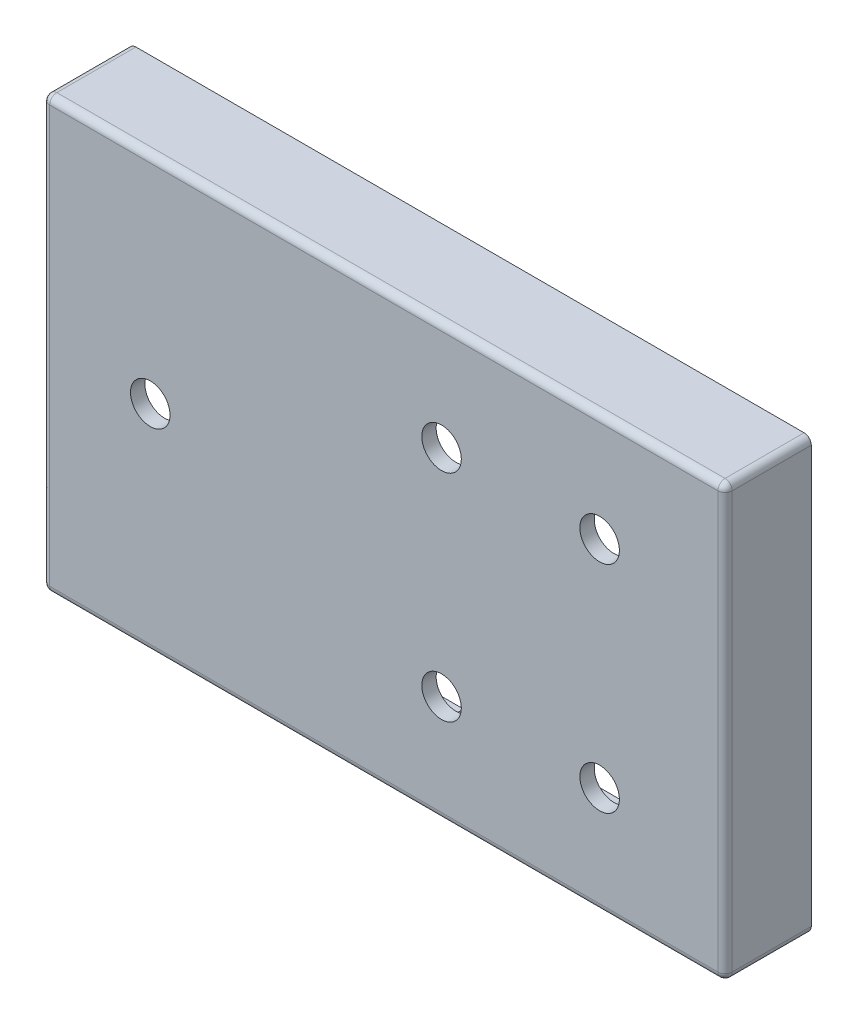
ISO-10303-21;
HEADER;
FILE_DESCRIPTION(('STEP AP214'),'2;1');
FILE_NAME('part.step','',(''),(''),'','','');
FILE_SCHEMA(('AUTOMOTIVE_DESIGN { 1 0 10303 214 1 1 1 1 }'));
ENDSEC;
DATA;
#1=APPLICATION_CONTEXT('core data for automotive mechanical design processes');
#2=APPLICATION_PROTOCOL_DEFINITION('international standard','automotive_design',2000,#1);
#3=PRODUCT_CONTEXT('',#1,'mechanical');
#4=PRODUCT('Part','Part','',(#3));
#5=PRODUCT_RELATED_PRODUCT_CATEGORY('part','',(#4));
#6=PRODUCT_DEFINITION_FORMATION('','',#4);
#7=PRODUCT_DEFINITION_CONTEXT('part definition',#1,'design');
#8=PRODUCT_DEFINITION('design','',#6,#7);
#9=PRODUCT_DEFINITION_SHAPE('','',#8);
#10=(LENGTH_UNIT() NAMED_UNIT(*) SI_UNIT(.MILLI.,.METRE.));
#11=(NAMED_UNIT(*) PLANE_ANGLE_UNIT() SI_UNIT($,.RADIAN.));
#12=(NAMED_UNIT(*) SI_UNIT($,.STERADIAN.) SOLID_ANGLE_UNIT());
#13=UNCERTAINTY_MEASURE_WITH_UNIT(LENGTH_MEASURE(1.E-05),#10,'distance_accuracy_value','');
#14=(GEOMETRIC_REPRESENTATION_CONTEXT(3) GLOBAL_UNCERTAINTY_ASSIGNED_CONTEXT((#13)) GLOBAL_UNIT_ASSIGNED_CONTEXT((#10,
#11,#12)) REPRESENTATION_CONTEXT('',''));
#15=CARTESIAN_POINT('',(0.,0.,0.));
#16=DIRECTION('',(0.,0.,1.));
#17=DIRECTION('',(1.,0.,0.));
#18=AXIS2_PLACEMENT_3D('',#15,#16,#17);
#19=CARTESIAN_POINT('',(-60.,-20.,10.));
#20=DIRECTION('',(0.,0.,1.));
#21=DIRECTION('',(1.,0.,0.));
#22=AXIS2_PLACEMENT_3D('',#19,#20,#21);
#23=PLANE('',#22);
#24=CARTESIAN_POINT('',(-45.,10.,10.));
#25=DIRECTION('',(0.,0.,1.));
#26=DIRECTION('',(1.,0.,0.));
#27=AXIS2_PLACEMENT_3D('',#24,#25,#26);
#28=CIRCLE('',#27,2.75);
#29=CARTESIAN_POINT('',(-42.25,10.,10.));
#30=VERTEX_POINT('',#29);
#31=EDGE_CURVE('E640',#30,#30,#28,.T.);
#32=ORIENTED_EDGE('',*,*,#31,.T.);
#33=EDGE_LOOP('',(#32));
#34=FACE_BOUND('',#33,.T.);
#35=CARTESIAN_POINT('',(-4.45993909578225,24.9581373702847,10.));
#36=DIRECTION('',(0.,0.,1.));
#37=DIRECTION('',(1.,0.,0.));
#38=AXIS2_PLACEMENT_3D('',#35,#36,#37);
#39=CIRCLE('',#38,2.75);
#40=CARTESIAN_POINT('',(-1.70993909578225,24.9581373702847,10.));
#41=VERTEX_POINT('',#40);
#42=EDGE_CURVE('E632',#41,#41,#39,.F.);
#43=ORIENTED_EDGE('',*,*,#42,.F.);
#44=EDGE_LOOP('',(#43));
#45=FACE_BOUND('',#44,.T.);
#46=CARTESIAN_POINT('',(-4.45993909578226,-5.0418626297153,10.));
#47=DIRECTION('',(0.,0.,1.));
#48=DIRECTION('',(1.,0.,0.));
#49=AXIS2_PLACEMENT_3D('',#46,#47,#48);
#50=CIRCLE('',#49,2.75);
#51=CARTESIAN_POINT('',(-1.70993909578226,-5.0418626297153,10.));
#52=VERTEX_POINT('',#51);
#53=EDGE_CURVE('E624',#52,#52,#50,.F.);
#54=ORIENTED_EDGE('',*,*,#53,.F.);
#55=EDGE_LOOP('',(#54));
#56=FACE_BOUND('',#55,.T.);
#57=CARTESIAN_POINT('',(17.5400609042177,24.9581373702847,10.));
#58=DIRECTION('',(0.,0.,1.));
#59=DIRECTION('',(1.,0.,0.));
#60=AXIS2_PLACEMENT_3D('',#57,#58,#59);
#61=CIRCLE('',#60,2.75);
#62=CARTESIAN_POINT('',(20.2900609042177,24.9581373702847,10.));
#63=VERTEX_POINT('',#62);
#64=EDGE_CURVE('E616',#63,#63,#61,.F.);
#65=ORIENTED_EDGE('',*,*,#64,.F.);
#66=EDGE_LOOP('',(#65));
#67=FACE_BOUND('',#66,.T.);
#68=CARTESIAN_POINT('',(17.5400609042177,-5.04186262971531,10.));
#69=DIRECTION('',(0.,0.,1.));
#70=DIRECTION('',(1.,0.,0.));
#71=AXIS2_PLACEMENT_3D('',#68,#69,#70);
#72=CIRCLE('',#71,2.75);
#73=CARTESIAN_POINT('',(20.2900609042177,-5.04186262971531,10.));
#74=VERTEX_POINT('',#73);
#75=EDGE_CURVE('E608',#74,#74,#72,.F.);
#76=ORIENTED_EDGE('',*,*,#75,.F.);
#77=EDGE_LOOP('',(#76));
#78=FACE_BOUND('',#77,.T.);
#79=CARTESIAN_POINT('',(-5.50000000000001,-13.,10.));
#80=DIRECTION('',(0.,0.,1.));
#81=DIRECTION('',(1.,0.,0.));
#82=AXIS2_PLACEMENT_3D('',#79,#80,#81);
#83=CIRCLE('',#82,2.75);
#84=CARTESIAN_POINT('',(-2.75000000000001,-13.,10.));
#85=VERTEX_POINT('',#84);
#86=EDGE_CURVE('E785',#85,#85,#83,.F.);
#87=ORIENTED_EDGE('',*,*,#86,.F.);
#88=EDGE_LOOP('',(#87));
#89=FACE_BOUND('',#88,.T.);
#90=CARTESIAN_POINT('',(-5.5,33.,10.));
#91=DIRECTION('',(0.,0.,1.));
#92=DIRECTION('',(1.,0.,0.));
#93=AXIS2_PLACEMENT_3D('',#90,#91,#92);
#94=CIRCLE('',#93,2.89975614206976);
#95=CARTESIAN_POINT('',(-2.60024385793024,33.,10.));
#96=VERTEX_POINT('',#95);
#97=EDGE_CURVE('E11',#96,#96,#94,.F.);
#98=ORIENTED_EDGE('',*,*,#97,.F.);
#99=EDGE_LOOP('',(#98));
#100=FACE_BOUND('',#99,.T.);
#101=DIRECTION('',(0.,-1.,0.));
#102=VECTOR('',#101,1.);
#103=CARTESIAN_POINT('',(-28.0000000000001,-16.,10.));
#104=LINE('',#103,#102);
#105=CARTESIAN_POINT('',(-28.0000000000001,-16.,10.));
#106=VERTEX_POINT('',#105);
#107=CARTESIAN_POINT('',(-28.0000000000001,-17.,10.));
#108=VERTEX_POINT('',#107);
#109=EDGE_CURVE('E592',#106,#108,#104,.T.);
#110=ORIENTED_EDGE('',*,*,#109,.F.);
#111=DIRECTION('',(1.,0.,0.));
#112=VECTOR('',#111,1.);
#113=CARTESIAN_POINT('',(-28.0000000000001,-16.,10.));
#114=LINE('',#113,#112);
#115=CARTESIAN_POINT('',(-29.0000000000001,-16.,10.));
#116=VERTEX_POINT('',#115);
#117=EDGE_CURVE('E595',#116,#106,#114,.T.);
#118=ORIENTED_EDGE('',*,*,#117,.F.);
#119=DIRECTION('',(0.,-1.,0.));
#120=VECTOR('',#119,1.);
#121=CARTESIAN_POINT('',(-29.0000000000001,-16.,10.));
#122=LINE('',#121,#120);
#123=CARTESIAN_POINT('',(-29.0000000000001,-17.,10.));
#124=VERTEX_POINT('',#123);
#125=EDGE_CURVE('E300',#116,#124,#122,.T.);
#126=ORIENTED_EDGE('',*,*,#125,.T.);
#127=DIRECTION('',(-1.,0.,0.));
#128=VECTOR('',#127,1.);
#129=CARTESIAN_POINT('',(-57.,-17.,10.));
#130=LINE('',#129,#128);
#131=CARTESIAN_POINT('',(-57.5,-17.,10.));
#132=VERTEX_POINT('',#131);
#133=EDGE_CURVE('E308',#124,#132,#130,.T.);
#134=ORIENTED_EDGE('',*,*,#133,.T.);
#135=DIRECTION('',(0.,-1.,0.));
#136=VECTOR('',#135,1.);
#137=CARTESIAN_POINT('',(-57.5,37.,10.));
#138=LINE('',#137,#136);
#139=CARTESIAN_POINT('',(-57.5,37.,10.));
#140=VERTEX_POINT('',#139);
#141=EDGE_CURVE('E414',#140,#132,#138,.T.);
#142=ORIENTED_EDGE('',*,*,#141,.F.);
#143=DIRECTION('',(1.,0.,0.));
#144=VECTOR('',#143,1.);
#145=CARTESIAN_POINT('',(-57.,37.,10.));
#146=LINE('',#145,#144);
#147=CARTESIAN_POINT('',(-29.0000000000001,37.0000000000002,10.));
#148=VERTEX_POINT('',#147);
#149=EDGE_CURVE('E350',#140,#148,#146,.T.);
#150=ORIENTED_EDGE('',*,*,#149,.T.);
#151=DIRECTION('',(0.,1.,0.));
#152=VECTOR('',#151,1.);
#153=CARTESIAN_POINT('',(-29.0000000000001,36.0000000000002,10.));
#154=LINE('',#153,#152);
#155=CARTESIAN_POINT('',(-29.0000000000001,36.0000000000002,10.));
#156=VERTEX_POINT('',#155);
#157=EDGE_CURVE('E528',#156,#148,#154,.T.);
#158=ORIENTED_EDGE('',*,*,#157,.F.);
#159=DIRECTION('',(-1.,0.,0.));
#160=VECTOR('',#159,1.);
#161=CARTESIAN_POINT('',(-28.0000000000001,36.0000000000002,10.));
#162=LINE('',#161,#160);
#163=CARTESIAN_POINT('',(-28.0000000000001,36.0000000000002,10.));
#164=VERTEX_POINT('',#163);
#165=EDGE_CURVE('E543',#164,#156,#162,.T.);
#166=ORIENTED_EDGE('',*,*,#165,.F.);
#167=DIRECTION('',(0.,1.,0.));
#168=VECTOR('',#167,1.);
#169=CARTESIAN_POINT('',(-28.0000000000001,36.0000000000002,10.));
#170=LINE('',#169,#168);
#171=CARTESIAN_POINT('',(-28.0000000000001,37.0000000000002,10.));
#172=VERTEX_POINT('',#171);
#173=EDGE_CURVE('E524',#164,#172,#170,.T.);
#174=ORIENTED_EDGE('',*,*,#173,.T.);
#175=CARTESIAN_POINT('',(-26.5000000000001,37.0000000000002,10.));
#176=VERTEX_POINT('',#175);
#177=EDGE_CURVE('E351',#172,#176,#146,.T.);
#178=ORIENTED_EDGE('',*,*,#177,.T.);
#179=DIRECTION('',(0.,1.,0.));
#180=VECTOR('',#179,1.);
#181=CARTESIAN_POINT('',(-26.5000000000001,36.0000000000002,10.));
#182=LINE('',#181,#180);
#183=CARTESIAN_POINT('',(-26.5000000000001,36.0000000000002,10.));
#184=VERTEX_POINT('',#183);
#185=EDGE_CURVE('E495',#184,#176,#182,.T.);
#186=ORIENTED_EDGE('',*,*,#185,.F.);
#187=DIRECTION('',(-1.,0.,0.));
#188=VECTOR('',#187,1.);
#189=CARTESIAN_POINT('',(-25.5000000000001,36.0000000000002,10.));
#190=LINE('',#189,#188);
#191=CARTESIAN_POINT('',(-25.5000000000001,36.0000000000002,10.));
#192=VERTEX_POINT('',#191);
#193=EDGE_CURVE('E511',#192,#184,#190,.T.);
#194=ORIENTED_EDGE('',*,*,#193,.F.);
#195=DIRECTION('',(0.,1.,0.));
#196=VECTOR('',#195,1.);
#197=CARTESIAN_POINT('',(-25.5000000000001,36.0000000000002,10.));
#198=LINE('',#197,#196);
#199=CARTESIAN_POINT('',(-25.5000000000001,37.0000000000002,10.));
#200=VERTEX_POINT('',#199);
#201=EDGE_CURVE('E491',#192,#200,#198,.T.);
#202=ORIENTED_EDGE('',*,*,#201,.T.);
#203=CARTESIAN_POINT('',(32.,37.,10.));
#204=VERTEX_POINT('',#203);
#205=EDGE_CURVE('E356',#200,#204,#146,.T.);
#206=ORIENTED_EDGE('',*,*,#205,.T.);
#207=DIRECTION('',(0.,-1.,0.));
#208=VECTOR('',#207,1.);
#209=CARTESIAN_POINT('',(32.,37.,10.));
#210=LINE('',#209,#208);
#211=CARTESIAN_POINT('',(32.,-17.,10.));
#212=VERTEX_POINT('',#211);
#213=EDGE_CURVE('E352',#204,#212,#210,.T.);
#214=ORIENTED_EDGE('',*,*,#213,.T.);
#215=CARTESIAN_POINT('',(-25.5000000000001,-17.,10.));
#216=VERTEX_POINT('',#215);
#217=EDGE_CURVE('E789',#212,#216,#130,.T.);
#218=ORIENTED_EDGE('',*,*,#217,.T.);
#219=DIRECTION('',(0.,-1.,0.));
#220=VECTOR('',#219,1.);
#221=CARTESIAN_POINT('',(-25.5000000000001,-16.,10.));
#222=LINE('',#221,#220);
#223=CARTESIAN_POINT('',(-25.5000000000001,-16.,10.));
#224=VERTEX_POINT('',#223);
#225=EDGE_CURVE('E567',#224,#216,#222,.T.);
#226=ORIENTED_EDGE('',*,*,#225,.F.);
#227=DIRECTION('',(1.,0.,0.));
#228=VECTOR('',#227,1.);
#229=CARTESIAN_POINT('',(-25.5000000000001,-16.,10.));
#230=LINE('',#229,#228);
#231=CARTESIAN_POINT('',(-26.5000000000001,-16.,10.));
#232=VERTEX_POINT('',#231);
#233=EDGE_CURVE('E570',#232,#224,#230,.T.);
#234=ORIENTED_EDGE('',*,*,#233,.F.);
#235=DIRECTION('',(0.,-1.,0.));
#236=VECTOR('',#235,1.);
#237=CARTESIAN_POINT('',(-26.5000000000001,-16.,10.));
#238=LINE('',#237,#236);
#239=CARTESIAN_POINT('',(-26.5000000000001,-17.,10.));
#240=VERTEX_POINT('',#239);
#241=EDGE_CURVE('E563',#232,#240,#238,.T.);
#242=ORIENTED_EDGE('',*,*,#241,.T.);
#243=EDGE_CURVE('E793',#240,#108,#130,.T.);
#244=ORIENTED_EDGE('',*,*,#243,.T.);
#245=EDGE_LOOP('',(#110,#118,#126,#134,#142,#150,#158,#166,#174,#178,#186,#194,#202,#206,#214,
#218,#226,#234,#242,#244));
#246=FACE_BOUND('',#245,.T.);
#247=ADVANCED_FACE('F41',(#34,#45,#56,#67,#78,#89,#100,#246),#23,.F.);
#248=CARTESIAN_POINT('',(-57.,-17.,0.));
#249=DIRECTION('',(0.,-1.,0.));
#250=DIRECTION('',(1.,0.,0.));
#251=AXIS2_PLACEMENT_3D('',#248,#249,#250);
#252=PLANE('',#251);
#253=DIRECTION('',(0.,0.,-1.));
#254=VECTOR('',#253,1.);
#255=CARTESIAN_POINT('',(-28.0000000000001,-17.,10.));
#256=LINE('',#255,#254);
#257=CARTESIAN_POINT('',(-28.0000000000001,-17.,0.));
#258=VERTEX_POINT('',#257);
#259=EDGE_CURVE('E57',#108,#258,#256,.T.);
#260=ORIENTED_EDGE('',*,*,#259,.F.);
#261=ORIENTED_EDGE('',*,*,#243,.F.);
#262=DIRECTION('',(0.,0.,1.));
#263=VECTOR('',#262,1.);
#264=CARTESIAN_POINT('',(-26.5000000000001,-17.,10.));
#265=LINE('',#264,#263);
#266=CARTESIAN_POINT('',(-26.5000000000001,-17.,0.));
#267=VERTEX_POINT('',#266);
#268=EDGE_CURVE('E583',#267,#240,#265,.T.);
#269=ORIENTED_EDGE('',*,*,#268,.F.);
#270=DIRECTION('',(1.,0.,0.));
#271=VECTOR('',#270,1.);
#272=CARTESIAN_POINT('',(-57.,-17.,0.));
#273=LINE('',#272,#271);
#274=EDGE_CURVE('E319',#258,#267,#273,.T.);
#275=ORIENTED_EDGE('',*,*,#274,.F.);
#276=EDGE_LOOP('',(#260,#261,#269,#275));
#277=FACE_BOUND('',#276,.T.);
#278=ADVANCED_FACE('F902',(#277),#252,.F.);
#279=DIRECTION('',(0.,0.,1.));
#280=VECTOR('',#279,1.);
#281=CARTESIAN_POINT('',(-29.0000000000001,-17.,10.));
#282=LINE('',#281,#280);
#283=CARTESIAN_POINT('',(-29.0000000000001,-17.,0.));
#284=VERTEX_POINT('',#283);
#285=EDGE_CURVE('E293',#284,#124,#282,.T.);
#286=ORIENTED_EDGE('',*,*,#285,.F.);
#287=CARTESIAN_POINT('',(-57.5,-17.,0.));
#288=VERTEX_POINT('',#287);
#289=EDGE_CURVE('E307',#288,#284,#273,.T.);
#290=ORIENTED_EDGE('',*,*,#289,.F.);
#291=DIRECTION('',(0.,0.,-1.));
#292=VECTOR('',#291,1.);
#293=CARTESIAN_POINT('',(-57.5,-17.,11.));
#294=LINE('',#293,#292);
#295=EDGE_CURVE('E473',#132,#288,#294,.T.);
#296=ORIENTED_EDGE('',*,*,#295,.F.);
#297=ORIENTED_EDGE('',*,*,#133,.F.);
#298=EDGE_LOOP('',(#286,#290,#296,#297));
#299=FACE_BOUND('',#298,.T.);
#300=ADVANCED_FACE('F305',(#299),#252,.F.);
#301=DIRECTION('',(0.,0.,-1.));
#302=VECTOR('',#301,1.);
#303=CARTESIAN_POINT('',(-25.5000000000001,-17.,10.));
#304=LINE('',#303,#302);
#305=CARTESIAN_POINT('',(-25.5000000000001,-17.,0.));
#306=VERTEX_POINT('',#305);
#307=EDGE_CURVE('E65',#216,#306,#304,.T.);
#308=ORIENTED_EDGE('',*,*,#307,.F.);
#309=ORIENTED_EDGE('',*,*,#217,.F.);
#310=DIRECTION('',(0.,0.,1.));
#311=VECTOR('',#310,1.);
#312=CARTESIAN_POINT('',(32.,-17.,0.));
#313=LINE('',#312,#311);
#314=CARTESIAN_POINT('',(32.,-17.,0.));
#315=VERTEX_POINT('',#314);
#316=EDGE_CURVE('E807',#315,#212,#313,.T.);
#317=ORIENTED_EDGE('',*,*,#316,.F.);
#318=EDGE_CURVE('E321',#306,#315,#273,.T.);
#319=ORIENTED_EDGE('',*,*,#318,.F.);
#320=EDGE_LOOP('',(#308,#309,#317,#319));
#321=FACE_BOUND('',#320,.T.);
#322=ADVANCED_FACE('F911',(#321),#252,.F.);
#323=CARTESIAN_POINT('',(-57.,37.,0.));
#324=DIRECTION('',(0.,1.,0.));
#325=DIRECTION('',(-1.,0.,0.));
#326=AXIS2_PLACEMENT_3D('',#323,#324,#325);
#327=PLANE('',#326);
#328=DIRECTION('',(0.,0.,1.));
#329=VECTOR('',#328,1.);
#330=CARTESIAN_POINT('',(-28.0000000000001,37.0000000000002,0.));
#331=LINE('',#330,#329);
#332=CARTESIAN_POINT('',(-28.0000000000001,37.0000000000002,0.));
#333=VERTEX_POINT('',#332);
#334=EDGE_CURVE('E553',#333,#172,#331,.T.);
#335=ORIENTED_EDGE('',*,*,#334,.F.);
#336=DIRECTION('',(-1.,0.,0.));
#337=VECTOR('',#336,1.);
#338=CARTESIAN_POINT('',(-57.,37.,0.));
#339=LINE('',#338,#337);
#340=CARTESIAN_POINT('',(-26.5000000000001,37.,0.));
#341=VERTEX_POINT('',#340);
#342=EDGE_CURVE('E818',#341,#333,#339,.T.);
#343=ORIENTED_EDGE('',*,*,#342,.F.);
#344=DIRECTION('',(0.,0.,-1.));
#345=VECTOR('',#344,1.);
#346=CARTESIAN_POINT('',(-26.5000000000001,37.0000000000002,0.));
#347=LINE('',#346,#345);
#348=EDGE_CURVE('E517',#176,#341,#347,.T.);
#349=ORIENTED_EDGE('',*,*,#348,.F.);
#350=ORIENTED_EDGE('',*,*,#177,.F.);
#351=EDGE_LOOP('',(#335,#343,#349,#350));
#352=FACE_BOUND('',#351,.T.);
#353=ADVANCED_FACE('F839',(#352),#327,.F.);
#354=DIRECTION('',(0.,0.,-1.));
#355=VECTOR('',#354,1.);
#356=CARTESIAN_POINT('',(-29.0000000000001,37.0000000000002,0.));
#357=LINE('',#356,#355);
#358=CARTESIAN_POINT('',(-29.0000000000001,37.,0.));
#359=VERTEX_POINT('',#358);
#360=EDGE_CURVE('E549',#148,#359,#357,.T.);
#361=ORIENTED_EDGE('',*,*,#360,.F.);
#362=ORIENTED_EDGE('',*,*,#149,.F.);
#363=DIRECTION('',(0.,0.,1.));
#364=VECTOR('',#363,1.);
#365=CARTESIAN_POINT('',(-57.5,37.,11.));
#366=LINE('',#365,#364);
#367=CARTESIAN_POINT('',(-57.5,37.,0.));
#368=VERTEX_POINT('',#367);
#369=EDGE_CURVE('E446',#368,#140,#366,.T.);
#370=ORIENTED_EDGE('',*,*,#369,.F.);
#371=EDGE_CURVE('E819',#359,#368,#339,.T.);
#372=ORIENTED_EDGE('',*,*,#371,.F.);
#373=EDGE_LOOP('',(#361,#362,#370,#372));
#374=FACE_BOUND('',#373,.T.);
#375=ADVANCED_FACE('F866',(#374),#327,.F.);
#376=DIRECTION('',(0.,0.,1.));
#377=VECTOR('',#376,1.);
#378=CARTESIAN_POINT('',(-25.5000000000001,37.0000000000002,0.));
#379=LINE('',#378,#377);
#380=CARTESIAN_POINT('',(-25.5000000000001,37.0000000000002,0.));
#381=VERTEX_POINT('',#380);
#382=EDGE_CURVE('E521',#381,#200,#379,.T.);
#383=ORIENTED_EDGE('',*,*,#382,.F.);
#384=CARTESIAN_POINT('',(32.,37.,0.));
#385=VERTEX_POINT('',#384);
#386=EDGE_CURVE('E812',#385,#381,#339,.T.);
#387=ORIENTED_EDGE('',*,*,#386,.F.);
#388=DIRECTION('',(0.,0.,1.));
#389=VECTOR('',#388,1.);
#390=CARTESIAN_POINT('',(32.,37.,0.));
#391=LINE('',#390,#389);
#392=EDGE_CURVE('E811',#385,#204,#391,.T.);
#393=ORIENTED_EDGE('',*,*,#392,.T.);
#394=ORIENTED_EDGE('',*,*,#205,.F.);
#395=EDGE_LOOP('',(#383,#387,#393,#394));
#396=FACE_BOUND('',#395,.T.);
#397=ADVANCED_FACE('F882',(#396),#327,.F.);
#398=CARTESIAN_POINT('',(-59.,-17.,10.));
#399=VERTEX_POINT('',#398);
#400=CARTESIAN_POINT('',(-60.,-17.,10.));
#401=VERTEX_POINT('',#400);
#402=EDGE_CURVE('E794',#399,#401,#130,.T.);
#403=ORIENTED_EDGE('',*,*,#402,.F.);
#404=DIRECTION('',(0.,0.,1.));
#405=VECTOR('',#404,1.);
#406=CARTESIAN_POINT('',(-59.,-17.,11.));
#407=LINE('',#406,#405);
#408=CARTESIAN_POINT('',(-59.,-17.,0.));
#409=VERTEX_POINT('',#408);
#410=EDGE_CURVE('E476',#409,#399,#407,.T.);
#411=ORIENTED_EDGE('',*,*,#410,.F.);
#412=CARTESIAN_POINT('',(-60.,-17.,0.));
#413=VERTEX_POINT('',#412);
#414=EDGE_CURVE('E318',#413,#409,#273,.T.);
#415=ORIENTED_EDGE('',*,*,#414,.F.);
#416=DIRECTION('',(0.,0.,-1.));
#417=VECTOR('',#416,1.);
#418=CARTESIAN_POINT('',(-60.,-17.,0.));
#419=LINE('',#418,#417);
#420=EDGE_CURVE('E329',#401,#413,#419,.T.);
#421=ORIENTED_EDGE('',*,*,#420,.F.);
#422=EDGE_LOOP('',(#403,#411,#415,#421));
#423=FACE_BOUND('',#422,.T.);
#424=ADVANCED_FACE('F923',(#423),#252,.F.);
#425=CARTESIAN_POINT('',(-59.,37.,0.));
#426=VERTEX_POINT('',#425);
#427=CARTESIAN_POINT('',(-60.,37.,0.));
#428=VERTEX_POINT('',#427);
#429=EDGE_CURVE('E820',#426,#428,#339,.T.);
#430=ORIENTED_EDGE('',*,*,#429,.F.);
#431=DIRECTION('',(0.,0.,-1.));
#432=VECTOR('',#431,1.);
#433=CARTESIAN_POINT('',(-59.,37.,11.));
#434=LINE('',#433,#432);
#435=CARTESIAN_POINT('',(-59.,37.,10.));
#436=VERTEX_POINT('',#435);
#437=EDGE_CURVE('E449',#436,#426,#434,.T.);
#438=ORIENTED_EDGE('',*,*,#437,.F.);
#439=CARTESIAN_POINT('',(-60.,37.,10.));
#440=VERTEX_POINT('',#439);
#441=EDGE_CURVE('E344',#440,#436,#146,.T.);
#442=ORIENTED_EDGE('',*,*,#441,.F.);
#443=DIRECTION('',(0.,0.,1.));
#444=VECTOR('',#443,1.);
#445=CARTESIAN_POINT('',(-60.,37.,0.));
#446=LINE('',#445,#444);
#447=EDGE_CURVE('E335',#428,#440,#446,.T.);
#448=ORIENTED_EDGE('',*,*,#447,.F.);
#449=EDGE_LOOP('',(#430,#438,#442,#448));
#450=FACE_BOUND('',#449,.T.);
#451=ADVANCED_FACE('F916',(#450),#327,.F.);
#452=ORIENTED_EDGE('',*,*,#441,.T.);
#453=DIRECTION('',(0.,1.,0.));
#454=VECTOR('',#453,1.);
#455=CARTESIAN_POINT('',(-59.,37.,10.));
#456=LINE('',#455,#454);
#457=EDGE_CURVE('E418',#399,#436,#456,.T.);
#458=ORIENTED_EDGE('',*,*,#457,.F.);
#459=ORIENTED_EDGE('',*,*,#402,.T.);
#460=DIRECTION('',(0.,-1.,0.));
#461=VECTOR('',#460,1.);
#462=CARTESIAN_POINT('',(-60.,40.,10.));
#463=LINE('',#462,#461);
#464=EDGE_CURVE('E357',#440,#401,#463,.T.);
#465=ORIENTED_EDGE('',*,*,#464,.F.);
#466=EDGE_LOOP('',(#452,#458,#459,#465));
#467=FACE_BOUND('',#466,.T.);
#468=ADVANCED_FACE('F905',(#467),#23,.F.);
#469=CARTESIAN_POINT('',(32.,37.,0.));
#470=DIRECTION('',(1.,0.,0.));
#471=DIRECTION('',(0.,1.,0.));
#472=AXIS2_PLACEMENT_3D('',#469,#470,#471);
#473=PLANE('',#472);
#474=ORIENTED_EDGE('',*,*,#213,.F.);
#475=ORIENTED_EDGE('',*,*,#392,.F.);
#476=DIRECTION('',(0.,1.,0.));
#477=VECTOR('',#476,1.);
#478=CARTESIAN_POINT('',(32.,37.,0.));
#479=LINE('',#478,#477);
#480=EDGE_CURVE('E325',#315,#385,#479,.T.);
#481=ORIENTED_EDGE('',*,*,#480,.F.);
#482=ORIENTED_EDGE('',*,*,#316,.T.);
#483=EDGE_LOOP('',(#474,#475,#481,#482));
#484=FACE_BOUND('',#483,.T.);
#485=ADVANCED_FACE('F879',(#484),#473,.F.);
#486=CARTESIAN_POINT('',(-60.,40.,12.));
#487=DIRECTION('',(1.,0.,0.));
#488=DIRECTION('',(0.,1.,0.));
#489=AXIS2_PLACEMENT_3D('',#486,#487,#488);
#490=PLANE('',#489);
#491=DIRECTION('',(0.,-1.,0.));
#492=VECTOR('',#491,1.);
#493=CARTESIAN_POINT('',(-60.,40.,11.));
#494=LINE('',#493,#492);
#495=CARTESIAN_POINT('',(-60.,-19.,11.));
#496=VERTEX_POINT('',#495);
#497=CARTESIAN_POINT('',(-60.,39.,11.));
#498=VERTEX_POINT('',#497);
#499=EDGE_CURVE('E774',#496,#498,#494,.F.);
#500=ORIENTED_EDGE('',*,*,#499,.T.);
#501=DIRECTION('',(0.,0.,-1.));
#502=VECTOR('',#501,1.);
#503=CARTESIAN_POINT('',(-60.,39.,12.));
#504=LINE('',#503,#502);
#505=CARTESIAN_POINT('',(-60.,39.,0.));
#506=VERTEX_POINT('',#505);
#507=EDGE_CURVE('E747',#498,#506,#504,.T.);
#508=ORIENTED_EDGE('',*,*,#507,.T.);
#509=DIRECTION('',(0.,-1.,0.));
#510=VECTOR('',#509,1.);
#511=CARTESIAN_POINT('',(-60.,40.,0.));
#512=LINE('',#511,#510);
#513=EDGE_CURVE('E803',#506,#428,#512,.T.);
#514=ORIENTED_EDGE('',*,*,#513,.T.);
#515=ORIENTED_EDGE('',*,*,#447,.T.);
#516=ORIENTED_EDGE('',*,*,#464,.T.);
#517=ORIENTED_EDGE('',*,*,#420,.T.);
#518=CARTESIAN_POINT('',(-60.,-19.,0.));
#519=VERTEX_POINT('',#518);
#520=EDGE_CURVE('E806',#413,#519,#512,.T.);
#521=ORIENTED_EDGE('',*,*,#520,.T.);
#522=DIRECTION('',(0.,0.,-1.));
#523=VECTOR('',#522,1.);
#524=CARTESIAN_POINT('',(-60.,-19.,12.));
#525=LINE('',#524,#523);
#526=EDGE_CURVE('E777',#519,#496,#525,.F.);
#527=ORIENTED_EDGE('',*,*,#526,.T.);
#528=EDGE_LOOP('',(#500,#508,#514,#515,#516,#517,#521,#527));
#529=FACE_BOUND('',#528,.T.);
#530=ADVANCED_FACE('F43',(#529),#490,.F.);
#531=CARTESIAN_POINT('',(-60.,-20.,12.));
#532=DIRECTION('',(0.,1.,0.));
#533=DIRECTION('',(0.,0.,1.));
#534=AXIS2_PLACEMENT_3D('',#531,#532,#533);
#535=PLANE('',#534);
#536=DIRECTION('',(1.,0.,0.));
#537=VECTOR('',#536,1.);
#538=CARTESIAN_POINT('',(-60.,-20.,0.));
#539=LINE('',#538,#537);
#540=CARTESIAN_POINT('',(-59.,-20.,0.));
#541=VERTEX_POINT('',#540);
#542=CARTESIAN_POINT('',(34.,-20.,0.));
#543=VERTEX_POINT('',#542);
#544=EDGE_CURVE('E799',#541,#543,#539,.T.);
#545=ORIENTED_EDGE('',*,*,#544,.T.);
#546=DIRECTION('',(0.,0.,-1.));
#547=VECTOR('',#546,1.);
#548=CARTESIAN_POINT('',(34.,-20.,12.));
#549=LINE('',#548,#547);
#550=CARTESIAN_POINT('',(34.,-20.,11.));
#551=VERTEX_POINT('',#550);
#552=EDGE_CURVE('E752',#543,#551,#549,.F.);
#553=ORIENTED_EDGE('',*,*,#552,.T.);
#554=DIRECTION('',(1.,0.,0.));
#555=VECTOR('',#554,1.);
#556=CARTESIAN_POINT('',(-60.,-20.,11.));
#557=LINE('',#556,#555);
#558=CARTESIAN_POINT('',(-59.,-20.,11.));
#559=VERTEX_POINT('',#558);
#560=EDGE_CURVE('E768',#551,#559,#557,.F.);
#561=ORIENTED_EDGE('',*,*,#560,.T.);
#562=DIRECTION('',(0.,0.,-1.));
#563=VECTOR('',#562,1.);
#564=CARTESIAN_POINT('',(-59.,-20.,12.));
#565=LINE('',#564,#563);
#566=EDGE_CURVE('E771',#559,#541,#565,.T.);
#567=ORIENTED_EDGE('',*,*,#566,.T.);
#568=EDGE_LOOP('',(#545,#553,#561,#567));
#569=FACE_BOUND('',#568,.T.);
#570=ADVANCED_FACE('F938',(#569),#535,.F.);
#571=CARTESIAN_POINT('',(35.,40.,12.));
#572=DIRECTION('',(-1.,0.,0.));
#573=DIRECTION('',(0.,-1.,0.));
#574=AXIS2_PLACEMENT_3D('',#571,#572,#573);
#575=PLANE('',#574);
#576=DIRECTION('',(0.,1.,0.));
#577=VECTOR('',#576,1.);
#578=CARTESIAN_POINT('',(35.,40.,0.));
#579=LINE('',#578,#577);
#580=CARTESIAN_POINT('',(35.,-19.,0.));
#581=VERTEX_POINT('',#580);
#582=CARTESIAN_POINT('',(35.,39.,0.));
#583=VERTEX_POINT('',#582);
#584=EDGE_CURVE('E712',#581,#583,#579,.T.);
#585=ORIENTED_EDGE('',*,*,#584,.T.);
#586=DIRECTION('',(0.,0.,-1.));
#587=VECTOR('',#586,1.);
#588=CARTESIAN_POINT('',(35.,39.,12.));
#589=LINE('',#588,#587);
#590=CARTESIAN_POINT('',(35.,39.,11.));
#591=VERTEX_POINT('',#590);
#592=EDGE_CURVE('E50',#583,#591,#589,.F.);
#593=ORIENTED_EDGE('',*,*,#592,.T.);
#594=DIRECTION('',(0.,1.,0.));
#595=VECTOR('',#594,1.);
#596=CARTESIAN_POINT('',(35.,-19.,11.));
#597=LINE('',#596,#595);
#598=CARTESIAN_POINT('',(35.,-19.,11.));
#599=VERTEX_POINT('',#598);
#600=EDGE_CURVE('E709',#591,#599,#597,.F.);
#601=ORIENTED_EDGE('',*,*,#600,.T.);
#602=DIRECTION('',(0.,0.,-1.));
#603=VECTOR('',#602,1.);
#604=CARTESIAN_POINT('',(35.,-19.,12.));
#605=LINE('',#604,#603);
#606=EDGE_CURVE('E679',#599,#581,#605,.T.);
#607=ORIENTED_EDGE('',*,*,#606,.T.);
#608=EDGE_LOOP('',(#585,#593,#601,#607));
#609=FACE_BOUND('',#608,.T.);
#610=ADVANCED_FACE('F708',(#609),#575,.F.);
#611=CARTESIAN_POINT('',(-60.,40.,12.));
#612=DIRECTION('',(0.,-1.,0.));
#613=DIRECTION('',(0.,0.,-1.));
#614=AXIS2_PLACEMENT_3D('',#611,#612,#613);
#615=PLANE('',#614);
#616=DIRECTION('',(-1.,0.,0.));
#617=VECTOR('',#616,1.);
#618=CARTESIAN_POINT('',(-60.,40.,0.));
#619=LINE('',#618,#617);
#620=CARTESIAN_POINT('',(34.,40.,0.));
#621=VERTEX_POINT('',#620);
#622=CARTESIAN_POINT('',(-59.,40.,0.));
#623=VERTEX_POINT('',#622);
#624=EDGE_CURVE('E739',#621,#623,#619,.T.);
#625=ORIENTED_EDGE('',*,*,#624,.T.);
#626=DIRECTION('',(0.,0.,-1.));
#627=VECTOR('',#626,1.);
#628=CARTESIAN_POINT('',(-59.,40.,12.));
#629=LINE('',#628,#627);
#630=CARTESIAN_POINT('',(-59.,40.,11.));
#631=VERTEX_POINT('',#630);
#632=EDGE_CURVE('E699',#623,#631,#629,.F.);
#633=ORIENTED_EDGE('',*,*,#632,.T.);
#634=DIRECTION('',(-1.,0.,0.));
#635=VECTOR('',#634,1.);
#636=CARTESIAN_POINT('',(34.,40.,11.));
#637=LINE('',#636,#635);
#638=CARTESIAN_POINT('',(34.,40.,11.));
#639=VERTEX_POINT('',#638);
#640=EDGE_CURVE('E727',#631,#639,#637,.F.);
#641=ORIENTED_EDGE('',*,*,#640,.T.);
#642=DIRECTION('',(0.,0.,-1.));
#643=VECTOR('',#642,1.);
#644=CARTESIAN_POINT('',(34.,40.,12.));
#645=LINE('',#644,#643);
#646=EDGE_CURVE('E721',#639,#621,#645,.T.);
#647=ORIENTED_EDGE('',*,*,#646,.T.);
#648=EDGE_LOOP('',(#625,#633,#641,#647));
#649=FACE_BOUND('',#648,.T.);
#650=ADVANCED_FACE('F656',(#649),#615,.F.);
#651=CARTESIAN_POINT('',(-60.,40.,12.));
#652=DIRECTION('',(0.,0.,1.));
#653=DIRECTION('',(1.,0.,0.));
#654=AXIS2_PLACEMENT_3D('',#651,#652,#653);
#655=PLANE('',#654);
#656=CARTESIAN_POINT('',(-45.,10.,12.));
#657=DIRECTION('',(0.,0.,1.));
#658=DIRECTION('',(1.,0.,0.));
#659=AXIS2_PLACEMENT_3D('',#656,#657,#658);
#660=CIRCLE('',#659,2.75);
#661=CARTESIAN_POINT('',(-42.25,10.,12.));
#662=VERTEX_POINT('',#661);
#663=EDGE_CURVE('E644',#662,#662,#660,.T.);
#664=ORIENTED_EDGE('',*,*,#663,.F.);
#665=EDGE_LOOP('',(#664));
#666=FACE_BOUND('',#665,.T.);
#667=CARTESIAN_POINT('',(-4.45993909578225,24.9581373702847,12.));
#668=DIRECTION('',(0.,0.,1.));
#669=DIRECTION('',(1.,0.,0.));
#670=AXIS2_PLACEMENT_3D('',#667,#668,#669);
#671=CIRCLE('',#670,2.75);
#672=CARTESIAN_POINT('',(-1.70993909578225,24.9581373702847,12.));
#673=VERTEX_POINT('',#672);
#674=EDGE_CURVE('E636',#673,#673,#671,.T.);
#675=ORIENTED_EDGE('',*,*,#674,.F.);
#676=EDGE_LOOP('',(#675));
#677=FACE_BOUND('',#676,.T.);
#678=CARTESIAN_POINT('',(-4.45993909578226,-5.0418626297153,12.));
#679=DIRECTION('',(0.,0.,1.));
#680=DIRECTION('',(1.,0.,0.));
#681=AXIS2_PLACEMENT_3D('',#678,#679,#680);
#682=CIRCLE('',#681,2.75);
#683=CARTESIAN_POINT('',(-1.70993909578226,-5.0418626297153,12.));
#684=VERTEX_POINT('',#683);
#685=EDGE_CURVE('E628',#684,#684,#682,.T.);
#686=ORIENTED_EDGE('',*,*,#685,.F.);
#687=EDGE_LOOP('',(#686));
#688=FACE_BOUND('',#687,.T.);
#689=CARTESIAN_POINT('',(17.5400609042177,24.9581373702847,12.));
#690=DIRECTION('',(0.,0.,1.));
#691=DIRECTION('',(1.,0.,0.));
#692=AXIS2_PLACEMENT_3D('',#689,#690,#691);
#693=CIRCLE('',#692,2.75);
#694=CARTESIAN_POINT('',(20.2900609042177,24.9581373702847,12.));
#695=VERTEX_POINT('',#694);
#696=EDGE_CURVE('E620',#695,#695,#693,.T.);
#697=ORIENTED_EDGE('',*,*,#696,.F.);
#698=EDGE_LOOP('',(#697));
#699=FACE_BOUND('',#698,.T.);
#700=CARTESIAN_POINT('',(17.5400609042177,-5.04186262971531,12.));
#701=DIRECTION('',(0.,0.,1.));
#702=DIRECTION('',(1.,0.,0.));
#703=AXIS2_PLACEMENT_3D('',#700,#701,#702);
#704=CIRCLE('',#703,2.75);
#705=CARTESIAN_POINT('',(20.2900609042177,-5.04186262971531,12.));
#706=VERTEX_POINT('',#705);
#707=EDGE_CURVE('E612',#706,#706,#704,.T.);
#708=ORIENTED_EDGE('',*,*,#707,.F.);
#709=EDGE_LOOP('',(#708));
#710=FACE_BOUND('',#709,.T.);
#711=DIRECTION('',(0.,1.,0.));
#712=VECTOR('',#711,1.);
#713=CARTESIAN_POINT('',(34.,40.,12.));
#714=LINE('',#713,#712);
#715=CARTESIAN_POINT('',(34.,-19.,12.));
#716=VERTEX_POINT('',#715);
#717=CARTESIAN_POINT('',(34.,39.,12.));
#718=VERTEX_POINT('',#717);
#719=EDGE_CURVE('E669',#716,#718,#714,.T.);
#720=ORIENTED_EDGE('',*,*,#719,.T.);
#721=DIRECTION('',(-1.,0.,0.));
#722=VECTOR('',#721,1.);
#723=CARTESIAN_POINT('',(-59.,39.,12.));
#724=LINE('',#723,#722);
#725=CARTESIAN_POINT('',(-59.,39.,12.));
#726=VERTEX_POINT('',#725);
#727=EDGE_CURVE('E672',#718,#726,#724,.T.);
#728=ORIENTED_EDGE('',*,*,#727,.T.);
#729=DIRECTION('',(0.,-1.,0.));
#730=VECTOR('',#729,1.);
#731=CARTESIAN_POINT('',(-59.,-20.,12.));
#732=LINE('',#731,#730);
#733=CARTESIAN_POINT('',(-59.,-19.,12.));
#734=VERTEX_POINT('',#733);
#735=EDGE_CURVE('E780',#726,#734,#732,.T.);
#736=ORIENTED_EDGE('',*,*,#735,.T.);
#737=DIRECTION('',(1.,0.,0.));
#738=VECTOR('',#737,1.);
#739=CARTESIAN_POINT('',(35.,-19.,12.));
#740=LINE('',#739,#738);
#741=EDGE_CURVE('E675',#734,#716,#740,.T.);
#742=ORIENTED_EDGE('',*,*,#741,.T.);
#743=EDGE_LOOP('',(#720,#728,#736,#742));
#744=FACE_BOUND('',#743,.T.);
#745=ADVANCED_FACE('F653',(#666,#677,#688,#699,#710,#744),#655,.T.);
#746=CARTESIAN_POINT('',(-60.,40.,0.));
#747=DIRECTION('',(0.,0.,1.));
#748=DIRECTION('',(1.,0.,0.));
#749=AXIS2_PLACEMENT_3D('',#746,#747,#748);
#750=PLANE('',#749);
#751=ORIENTED_EDGE('',*,*,#414,.T.);
#752=DIRECTION('',(0.,1.,0.));
#753=VECTOR('',#752,1.);
#754=CARTESIAN_POINT('',(-59.,-18.,0.));
#755=LINE('',#754,#753);
#756=CARTESIAN_POINT('',(-59.,-18.,0.));
#757=VERTEX_POINT('',#756);
#758=EDGE_CURVE('E452',#757,#409,#755,.T.);
#759=ORIENTED_EDGE('',*,*,#758,.F.);
#760=DIRECTION('',(-1.,0.,0.));
#761=VECTOR('',#760,1.);
#762=CARTESIAN_POINT('',(-59.,-18.,0.));
#763=LINE('',#762,#761);
#764=CARTESIAN_POINT('',(-57.5,-18.,0.));
#765=VERTEX_POINT('',#764);
#766=EDGE_CURVE('E455',#765,#757,#763,.T.);
#767=ORIENTED_EDGE('',*,*,#766,.F.);
#768=DIRECTION('',(0.,1.,0.));
#769=VECTOR('',#768,1.);
#770=CARTESIAN_POINT('',(-57.5,-18.,0.));
#771=LINE('',#770,#769);
#772=EDGE_CURVE('E316',#765,#288,#771,.T.);
#773=ORIENTED_EDGE('',*,*,#772,.T.);
#774=ORIENTED_EDGE('',*,*,#289,.T.);
#775=DIRECTION('',(0.,-1.,0.));
#776=VECTOR('',#775,1.);
#777=CARTESIAN_POINT('',(-29.0000000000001,-16.,0.));
#778=LINE('',#777,#776);
#779=CARTESIAN_POINT('',(-29.0000000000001,-16.,0.));
#780=VERTEX_POINT('',#779);
#781=EDGE_CURVE('E289',#780,#284,#778,.T.);
#782=ORIENTED_EDGE('',*,*,#781,.F.);
#783=DIRECTION('',(-1.,0.,0.));
#784=VECTOR('',#783,1.);
#785=CARTESIAN_POINT('',(-28.0000000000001,-16.,0.));
#786=LINE('',#785,#784);
#787=CARTESIAN_POINT('',(-28.0000000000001,-16.,0.));
#788=VERTEX_POINT('',#787);
#789=EDGE_CURVE('E600',#788,#780,#786,.T.);
#790=ORIENTED_EDGE('',*,*,#789,.F.);
#791=DIRECTION('',(0.,-1.,0.));
#792=VECTOR('',#791,1.);
#793=CARTESIAN_POINT('',(-28.0000000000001,-16.,0.));
#794=LINE('',#793,#792);
#795=EDGE_CURVE('E299',#788,#258,#794,.T.);
#796=ORIENTED_EDGE('',*,*,#795,.T.);
#797=ORIENTED_EDGE('',*,*,#274,.T.);
#798=DIRECTION('',(0.,-1.,0.));
#799=VECTOR('',#798,1.);
#800=CARTESIAN_POINT('',(-26.5000000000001,-16.,0.));
#801=LINE('',#800,#799);
#802=CARTESIAN_POINT('',(-26.5000000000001,-16.,0.));
#803=VERTEX_POINT('',#802);
#804=EDGE_CURVE('E559',#803,#267,#801,.T.);
#805=ORIENTED_EDGE('',*,*,#804,.F.);
#806=DIRECTION('',(-1.,0.,0.));
#807=VECTOR('',#806,1.);
#808=CARTESIAN_POINT('',(-25.5000000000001,-16.,0.));
#809=LINE('',#808,#807);
#810=CARTESIAN_POINT('',(-25.5000000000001,-16.,0.));
#811=VERTEX_POINT('',#810);
#812=EDGE_CURVE('E576',#811,#803,#809,.T.);
#813=ORIENTED_EDGE('',*,*,#812,.F.);
#814=DIRECTION('',(0.,-1.,0.));
#815=VECTOR('',#814,1.);
#816=CARTESIAN_POINT('',(-25.5000000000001,-16.,0.));
#817=LINE('',#816,#815);
#818=EDGE_CURVE('E556',#811,#306,#817,.T.);
#819=ORIENTED_EDGE('',*,*,#818,.T.);
#820=ORIENTED_EDGE('',*,*,#318,.T.);
#821=ORIENTED_EDGE('',*,*,#480,.T.);
#822=ORIENTED_EDGE('',*,*,#386,.T.);
#823=DIRECTION('',(0.,1.,0.));
#824=VECTOR('',#823,1.);
#825=CARTESIAN_POINT('',(-25.5000000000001,36.0000000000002,0.));
#826=LINE('',#825,#824);
#827=CARTESIAN_POINT('',(-25.5000000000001,36.0000000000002,0.));
#828=VERTEX_POINT('',#827);
#829=EDGE_CURVE('E502',#828,#381,#826,.T.);
#830=ORIENTED_EDGE('',*,*,#829,.F.);
#831=DIRECTION('',(1.,0.,0.));
#832=VECTOR('',#831,1.);
#833=CARTESIAN_POINT('',(-25.5000000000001,36.0000000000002,0.));
#834=LINE('',#833,#832);
#835=CARTESIAN_POINT('',(-26.5000000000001,36.0000000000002,0.));
#836=VERTEX_POINT('',#835);
#837=EDGE_CURVE('E505',#836,#828,#834,.T.);
#838=ORIENTED_EDGE('',*,*,#837,.F.);
#839=DIRECTION('',(0.,1.,0.));
#840=VECTOR('',#839,1.);
#841=CARTESIAN_POINT('',(-26.5000000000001,36.0000000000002,0.));
#842=LINE('',#841,#840);
#843=EDGE_CURVE('E499',#836,#341,#842,.T.);
#844=ORIENTED_EDGE('',*,*,#843,.T.);
#845=ORIENTED_EDGE('',*,*,#342,.T.);
#846=DIRECTION('',(0.,1.,0.));
#847=VECTOR('',#846,1.);
#848=CARTESIAN_POINT('',(-28.0000000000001,36.0000000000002,0.));
#849=LINE('',#848,#847);
#850=CARTESIAN_POINT('',(-28.0000000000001,36.0000000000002,0.));
#851=VERTEX_POINT('',#850);
#852=EDGE_CURVE('E534',#851,#333,#849,.T.);
#853=ORIENTED_EDGE('',*,*,#852,.F.);
#854=DIRECTION('',(1.,0.,0.));
#855=VECTOR('',#854,1.);
#856=CARTESIAN_POINT('',(-28.0000000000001,36.0000000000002,0.));
#857=LINE('',#856,#855);
#858=CARTESIAN_POINT('',(-29.0000000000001,36.0000000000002,0.));
#859=VERTEX_POINT('',#858);
#860=EDGE_CURVE('E537',#859,#851,#857,.T.);
#861=ORIENTED_EDGE('',*,*,#860,.F.);
#862=DIRECTION('',(0.,1.,0.));
#863=VECTOR('',#862,1.);
#864=CARTESIAN_POINT('',(-29.0000000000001,36.0000000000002,0.));
#865=LINE('',#864,#863);
#866=EDGE_CURVE('E531',#859,#359,#865,.T.);
#867=ORIENTED_EDGE('',*,*,#866,.T.);
#868=ORIENTED_EDGE('',*,*,#371,.T.);
#869=DIRECTION('',(0.,-1.,0.));
#870=VECTOR('',#869,1.);
#871=CARTESIAN_POINT('',(-57.5,38.,0.));
#872=LINE('',#871,#870);
#873=CARTESIAN_POINT('',(-57.5,38.,0.));
#874=VERTEX_POINT('',#873);
#875=EDGE_CURVE('E422',#874,#368,#872,.T.);
#876=ORIENTED_EDGE('',*,*,#875,.F.);
#877=DIRECTION('',(1.,0.,0.));
#878=VECTOR('',#877,1.);
#879=CARTESIAN_POINT('',(-59.,38.,0.));
#880=LINE('',#879,#878);
#881=CARTESIAN_POINT('',(-59.,38.,0.));
#882=VERTEX_POINT('',#881);
#883=EDGE_CURVE('E438',#882,#874,#880,.T.);
#884=ORIENTED_EDGE('',*,*,#883,.F.);
#885=DIRECTION('',(0.,-1.,0.));
#886=VECTOR('',#885,1.);
#887=CARTESIAN_POINT('',(-59.,38.,0.));
#888=LINE('',#887,#886);
#889=EDGE_CURVE('E423',#882,#426,#888,.T.);
#890=ORIENTED_EDGE('',*,*,#889,.T.);
#891=ORIENTED_EDGE('',*,*,#429,.T.);
#892=ORIENTED_EDGE('',*,*,#513,.F.);
#893=CARTESIAN_POINT('',(-59.,39.,0.));
#894=DIRECTION('',(0.,0.,1.));
#895=DIRECTION('',(1.,0.,0.));
#896=AXIS2_PLACEMENT_3D('',#893,#894,#895);
#897=CIRCLE('',#896,1.);
#898=EDGE_CURVE('E728',#506,#623,#897,.F.);
#899=ORIENTED_EDGE('',*,*,#898,.T.);
#900=ORIENTED_EDGE('',*,*,#624,.F.);
#901=CARTESIAN_POINT('',(34.,39.,0.));
#902=DIRECTION('',(0.,0.,1.));
#903=DIRECTION('',(1.,0.,0.));
#904=AXIS2_PLACEMENT_3D('',#901,#902,#903);
#905=CIRCLE('',#904,1.);
#906=EDGE_CURVE('E722',#621,#583,#905,.F.);
#907=ORIENTED_EDGE('',*,*,#906,.T.);
#908=ORIENTED_EDGE('',*,*,#584,.F.);
#909=CARTESIAN_POINT('',(34.,-19.,0.));
#910=DIRECTION('',(0.,0.,1.));
#911=DIRECTION('',(1.,0.,0.));
#912=AXIS2_PLACEMENT_3D('',#909,#910,#911);
#913=CIRCLE('',#912,1.);
#914=EDGE_CURVE('E757',#581,#543,#913,.F.);
#915=ORIENTED_EDGE('',*,*,#914,.T.);
#916=ORIENTED_EDGE('',*,*,#544,.F.);
#917=CARTESIAN_POINT('',(-59.,-19.,0.));
#918=DIRECTION('',(0.,0.,1.));
#919=DIRECTION('',(1.,0.,0.));
#920=AXIS2_PLACEMENT_3D('',#917,#918,#919);
#921=CIRCLE('',#920,1.);
#922=EDGE_CURVE('E680',#541,#519,#921,.F.);
#923=ORIENTED_EDGE('',*,*,#922,.T.);
#924=ORIENTED_EDGE('',*,*,#520,.F.);
#925=EDGE_LOOP('',(#751,#759,#767,#773,#774,#782,#790,#796,#797,#805,#813,#819,#820,#821,#822,
#830,#838,#844,#845,#853,#861,#867,#868,#876,#884,#890,#891,#892,#899,#900,#907,#908,#915,#916,
#923,#924));
#926=FACE_BOUND('',#925,.T.);
#927=ADVANCED_FACE('F314',(#926),#750,.F.);
#928=CARTESIAN_POINT('',(-5.50000000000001,-13.,0.));
#929=DIRECTION('',(0.,0.,1.));
#930=DIRECTION('',(1.,0.,0.));
#931=AXIS2_PLACEMENT_3D('',#928,#929,#930);
#932=CYLINDRICAL_SURFACE('',#931,2.75);
#933=CARTESIAN_POINT('',(-5.50000000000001,-13.,0.));
#934=DIRECTION('',(0.,0.,-1.));
#935=DIRECTION('',(-1.,0.,0.));
#936=AXIS2_PLACEMENT_3D('',#933,#934,#935);
#937=CIRCLE('',#936,2.75);
#938=CARTESIAN_POINT('',(-8.25,-13.,0.));
#939=VERTEX_POINT('',#938);
#940=EDGE_CURVE('E360',#939,#939,#937,.T.);
#941=ORIENTED_EDGE('',*,*,#940,.F.);
#942=EDGE_LOOP('',(#941));
#943=FACE_BOUND('',#942,.T.);
#944=ORIENTED_EDGE('',*,*,#86,.T.);
#945=EDGE_LOOP('',(#944));
#946=FACE_BOUND('',#945,.T.);
#947=ADVANCED_FACE('F1206',(#943,#946),#932,.T.);
#948=CARTESIAN_POINT('',(-5.50000000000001,-13.,0.));
#949=DIRECTION('',(0.,0.,-1.));
#950=DIRECTION('',(-1.,0.,0.));
#951=AXIS2_PLACEMENT_3D('',#948,#949,#950);
#952=PLANE('',#951);
#953=CARTESIAN_POINT('',(-5.50000000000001,-13.,0.));
#954=DIRECTION('',(0.,0.,-1.));
#955=DIRECTION('',(-1.,0.,0.));
#956=AXIS2_PLACEMENT_3D('',#953,#954,#955);
#957=CIRCLE('',#956,0.899999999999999);
#958=CARTESIAN_POINT('',(-6.4,-13.,0.));
#959=VERTEX_POINT('',#958);
#960=EDGE_CURVE('E368',#959,#959,#957,.T.);
#961=ORIENTED_EDGE('',*,*,#960,.F.);
#962=EDGE_LOOP('',(#961));
#963=FACE_BOUND('',#962,.T.);
#964=ORIENTED_EDGE('',*,*,#940,.T.);
#965=EDGE_LOOP('',(#964));
#966=FACE_BOUND('',#965,.T.);
#967=ADVANCED_FACE('F1203',(#963,#966),#952,.T.);
#968=CARTESIAN_POINT('',(-5.50000000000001,-13.,6.));
#969=DIRECTION('',(0.,0.,-1.));
#970=DIRECTION('',(-1.,0.,0.));
#971=AXIS2_PLACEMENT_3D('',#968,#969,#970);
#972=CYLINDRICAL_SURFACE('',#971,0.899999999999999);
#973=CARTESIAN_POINT('',(-5.50000000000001,-13.,6.));
#974=DIRECTION('',(0.,0.,-1.));
#975=DIRECTION('',(-1.,0.,0.));
#976=AXIS2_PLACEMENT_3D('',#973,#974,#975);
#977=CIRCLE('',#976,0.899999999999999);
#978=CARTESIAN_POINT('',(-6.4,-13.,6.));
#979=VERTEX_POINT('',#978);
#980=EDGE_CURVE('E364',#979,#979,#977,.T.);
#981=ORIENTED_EDGE('',*,*,#980,.F.);
#982=EDGE_LOOP('',(#981));
#983=FACE_BOUND('',#982,.T.);
#984=ORIENTED_EDGE('',*,*,#960,.T.);
#985=EDGE_LOOP('',(#984));
#986=FACE_BOUND('',#985,.T.);
#987=ADVANCED_FACE('F1199',(#983,#986),#972,.F.);
#988=CARTESIAN_POINT('',(-5.50000000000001,-13.,6.));
#989=DIRECTION('',(0.,0.,-1.));
#990=DIRECTION('',(-1.,0.,0.));
#991=AXIS2_PLACEMENT_3D('',#988,#989,#990);
#992=PLANE('',#991);
#993=ORIENTED_EDGE('',*,*,#980,.T.);
#994=EDGE_LOOP('',(#993));
#995=FACE_BOUND('',#994,.T.);
#996=ADVANCED_FACE('F1196',(#995),#992,.T.);
#997=CARTESIAN_POINT('',(-60.,-19.,11.));
#998=DIRECTION('',(-1.,0.,0.));
#999=DIRECTION('',(0.,0.,1.));
#1000=AXIS2_PLACEMENT_3D('',#997,#998,#999);
#1001=CYLINDRICAL_SURFACE('',#1000,1.);
#1002=ORIENTED_EDGE('',*,*,#560,.F.);
#1003=CARTESIAN_POINT('',(34.,-19.,11.));
#1004=DIRECTION('',(-1.,0.,0.));
#1005=DIRECTION('',(0.,0.,1.));
#1006=AXIS2_PLACEMENT_3D('',#1003,#1004,#1005);
#1007=CIRCLE('',#1006,1.);
#1008=EDGE_CURVE('E717',#551,#716,#1007,.T.);
#1009=ORIENTED_EDGE('',*,*,#1008,.T.);
#1010=ORIENTED_EDGE('',*,*,#741,.F.);
#1011=CARTESIAN_POINT('',(-59.,-19.,11.));
#1012=DIRECTION('',(-1.,0.,0.));
#1013=DIRECTION('',(0.,0.,1.));
#1014=AXIS2_PLACEMENT_3D('',#1011,#1012,#1013);
#1015=CIRCLE('',#1014,1.);
#1016=EDGE_CURVE('E372',#559,#734,#1015,.T.);
#1017=ORIENTED_EDGE('',*,*,#1016,.F.);
#1018=EDGE_LOOP('',(#1002,#1009,#1010,#1017));
#1019=FACE_BOUND('',#1018,.T.);
#1020=ADVANCED_FACE('F942',(#1019),#1001,.T.);
#1021=CARTESIAN_POINT('',(-59.,-19.,12.));
#1022=DIRECTION('',(0.,0.,-1.));
#1023=DIRECTION('',(-1.,0.,0.));
#1024=AXIS2_PLACEMENT_3D('',#1021,#1022,#1023);
#1025=CYLINDRICAL_SURFACE('',#1024,1.);
#1026=ORIENTED_EDGE('',*,*,#922,.F.);
#1027=ORIENTED_EDGE('',*,*,#566,.F.);
#1028=CARTESIAN_POINT('',(-59.,-19.,11.));
#1029=DIRECTION('',(0.,0.,1.));
#1030=DIRECTION('',(1.,0.,0.));
#1031=AXIS2_PLACEMENT_3D('',#1028,#1029,#1030);
#1032=CIRCLE('',#1031,1.);
#1033=EDGE_CURVE('E376',#496,#559,#1032,.T.);
#1034=ORIENTED_EDGE('',*,*,#1033,.F.);
#1035=ORIENTED_EDGE('',*,*,#526,.F.);
#1036=EDGE_LOOP('',(#1026,#1027,#1034,#1035));
#1037=FACE_BOUND('',#1036,.T.);
#1038=ADVANCED_FACE('F951',(#1037),#1025,.T.);
#1039=CARTESIAN_POINT('',(-59.,-19.,11.));
#1040=DIRECTION('',(0.,0.,1.));
#1041=DIRECTION('',(1.,0.,0.));
#1042=AXIS2_PLACEMENT_3D('',#1039,#1040,#1041);
#1043=SPHERICAL_SURFACE('',#1042,1.);
#1044=ORIENTED_EDGE('',*,*,#1033,.T.);
#1045=ORIENTED_EDGE('',*,*,#1016,.T.);
#1046=CARTESIAN_POINT('',(-59.,-19.,11.));
#1047=DIRECTION('',(0.,-1.,0.));
#1048=DIRECTION('',(0.,0.,-1.));
#1049=AXIS2_PLACEMENT_3D('',#1046,#1047,#1048);
#1050=CIRCLE('',#1049,1.);
#1051=EDGE_CURVE('E380',#496,#734,#1050,.F.);
#1052=ORIENTED_EDGE('',*,*,#1051,.F.);
#1053=EDGE_LOOP('',(#1044,#1045,#1052));
#1054=FACE_BOUND('',#1053,.T.);
#1055=ADVANCED_FACE('F946',(#1054),#1043,.T.);
#1056=CARTESIAN_POINT('',(-59.,40.,11.));
#1057=DIRECTION('',(0.,1.,0.));
#1058=DIRECTION('',(-1.,0.,0.));
#1059=AXIS2_PLACEMENT_3D('',#1056,#1057,#1058);
#1060=CYLINDRICAL_SURFACE('',#1059,1.);
#1061=ORIENTED_EDGE('',*,*,#735,.F.);
#1062=CARTESIAN_POINT('',(-59.,39.,11.));
#1063=DIRECTION('',(0.,1.,0.));
#1064=DIRECTION('',(-1.,0.,0.));
#1065=AXIS2_PLACEMENT_3D('',#1062,#1063,#1064);
#1066=CIRCLE('',#1065,1.);
#1067=EDGE_CURVE('E693',#726,#498,#1066,.F.);
#1068=ORIENTED_EDGE('',*,*,#1067,.T.);
#1069=ORIENTED_EDGE('',*,*,#499,.F.);
#1070=ORIENTED_EDGE('',*,*,#1051,.T.);
#1071=EDGE_LOOP('',(#1061,#1068,#1069,#1070));
#1072=FACE_BOUND('',#1071,.T.);
#1073=ADVANCED_FACE('F953',(#1072),#1060,.T.);
#1074=CARTESIAN_POINT('',(34.,-19.,12.));
#1075=DIRECTION('',(0.,0.,-1.));
#1076=DIRECTION('',(-1.,0.,0.));
#1077=AXIS2_PLACEMENT_3D('',#1074,#1075,#1076);
#1078=CYLINDRICAL_SURFACE('',#1077,1.);
#1079=CARTESIAN_POINT('',(34.,-19.,11.));
#1080=DIRECTION('',(0.,0.,1.));
#1081=DIRECTION('',(1.,0.,0.));
#1082=AXIS2_PLACEMENT_3D('',#1079,#1080,#1081);
#1083=CIRCLE('',#1082,1.);
#1084=EDGE_CURVE('E384',#551,#599,#1083,.T.);
#1085=ORIENTED_EDGE('',*,*,#1084,.F.);
#1086=ORIENTED_EDGE('',*,*,#552,.F.);
#1087=ORIENTED_EDGE('',*,*,#914,.F.);
#1088=ORIENTED_EDGE('',*,*,#606,.F.);
#1089=EDGE_LOOP('',(#1085,#1086,#1087,#1088));
#1090=FACE_BOUND('',#1089,.T.);
#1091=ADVANCED_FACE('F934',(#1090),#1078,.T.);
#1092=CARTESIAN_POINT('',(34.,-19.,11.));
#1093=DIRECTION('',(0.,0.,1.));
#1094=DIRECTION('',(1.,0.,0.));
#1095=AXIS2_PLACEMENT_3D('',#1092,#1093,#1094);
#1096=SPHERICAL_SURFACE('',#1095,1.);
#1097=ORIENTED_EDGE('',*,*,#1008,.F.);
#1098=ORIENTED_EDGE('',*,*,#1084,.T.);
#1099=CARTESIAN_POINT('',(34.,-19.,11.));
#1100=DIRECTION('',(0.,1.,0.));
#1101=DIRECTION('',(0.,0.,1.));
#1102=AXIS2_PLACEMENT_3D('',#1099,#1100,#1101);
#1103=CIRCLE('',#1102,1.);
#1104=EDGE_CURVE('E388',#716,#599,#1103,.T.);
#1105=ORIENTED_EDGE('',*,*,#1104,.F.);
#1106=EDGE_LOOP('',(#1097,#1098,#1105));
#1107=FACE_BOUND('',#1106,.T.);
#1108=ADVANCED_FACE('F1182',(#1107),#1096,.T.);
#1109=CARTESIAN_POINT('',(34.,40.,11.));
#1110=DIRECTION('',(0.,-1.,0.));
#1111=DIRECTION('',(1.,0.,0.));
#1112=AXIS2_PLACEMENT_3D('',#1109,#1110,#1111);
#1113=CYLINDRICAL_SURFACE('',#1112,1.);
#1114=ORIENTED_EDGE('',*,*,#600,.F.);
#1115=CARTESIAN_POINT('',(34.,39.,11.));
#1116=DIRECTION('',(0.,-1.,0.));
#1117=DIRECTION('',(1.,0.,0.));
#1118=AXIS2_PLACEMENT_3D('',#1115,#1116,#1117);
#1119=CIRCLE('',#1118,1.);
#1120=EDGE_CURVE('E685',#591,#718,#1119,.T.);
#1121=ORIENTED_EDGE('',*,*,#1120,.T.);
#1122=ORIENTED_EDGE('',*,*,#719,.F.);
#1123=ORIENTED_EDGE('',*,*,#1104,.T.);
#1124=EDGE_LOOP('',(#1114,#1121,#1122,#1123));
#1125=FACE_BOUND('',#1124,.T.);
#1126=ADVANCED_FACE('F715',(#1125),#1113,.T.);
#1127=CARTESIAN_POINT('',(34.,39.,12.));
#1128=DIRECTION('',(0.,0.,-1.));
#1129=DIRECTION('',(-1.,0.,0.));
#1130=AXIS2_PLACEMENT_3D('',#1127,#1128,#1129);
#1131=CYLINDRICAL_SURFACE('',#1130,1.);
#1132=CARTESIAN_POINT('',(34.,39.,11.));
#1133=DIRECTION('',(0.,0.,1.));
#1134=DIRECTION('',(1.,0.,0.));
#1135=AXIS2_PLACEMENT_3D('',#1132,#1133,#1134);
#1136=CIRCLE('',#1135,1.);
#1137=EDGE_CURVE('E392',#591,#639,#1136,.T.);
#1138=ORIENTED_EDGE('',*,*,#1137,.F.);
#1139=ORIENTED_EDGE('',*,*,#592,.F.);
#1140=ORIENTED_EDGE('',*,*,#906,.F.);
#1141=ORIENTED_EDGE('',*,*,#646,.F.);
#1142=EDGE_LOOP('',(#1138,#1139,#1140,#1141));
#1143=FACE_BOUND('',#1142,.T.);
#1144=ADVANCED_FACE('F720',(#1143),#1131,.T.);
#1145=CARTESIAN_POINT('',(34.,39.,11.));
#1146=DIRECTION('',(0.,0.,1.));
#1147=DIRECTION('',(1.,0.,0.));
#1148=AXIS2_PLACEMENT_3D('',#1145,#1146,#1147);
#1149=SPHERICAL_SURFACE('',#1148,1.);
#1150=ORIENTED_EDGE('',*,*,#1120,.F.);
#1151=ORIENTED_EDGE('',*,*,#1137,.T.);
#1152=CARTESIAN_POINT('',(34.,39.,11.));
#1153=DIRECTION('',(-1.,0.,0.));
#1154=DIRECTION('',(0.,0.,1.));
#1155=AXIS2_PLACEMENT_3D('',#1152,#1153,#1154);
#1156=CIRCLE('',#1155,1.);
#1157=EDGE_CURVE('E396',#718,#639,#1156,.T.);
#1158=ORIENTED_EDGE('',*,*,#1157,.F.);
#1159=EDGE_LOOP('',(#1150,#1151,#1158));
#1160=FACE_BOUND('',#1159,.T.);
#1161=ADVANCED_FACE('F684',(#1160),#1149,.T.);
#1162=CARTESIAN_POINT('',(-60.,39.,11.));
#1163=DIRECTION('',(1.,0.,0.));
#1164=DIRECTION('',(0.,0.,-1.));
#1165=AXIS2_PLACEMENT_3D('',#1162,#1163,#1164);
#1166=CYLINDRICAL_SURFACE('',#1165,1.);
#1167=CARTESIAN_POINT('',(-59.,39.,11.));
#1168=DIRECTION('',(-1.,0.,0.));
#1169=DIRECTION('',(0.,0.,1.));
#1170=AXIS2_PLACEMENT_3D('',#1167,#1168,#1169);
#1171=CIRCLE('',#1170,1.);
#1172=EDGE_CURVE('E400',#726,#631,#1171,.T.);
#1173=ORIENTED_EDGE('',*,*,#1172,.F.);
#1174=ORIENTED_EDGE('',*,*,#727,.F.);
#1175=ORIENTED_EDGE('',*,*,#1157,.T.);
#1176=ORIENTED_EDGE('',*,*,#640,.F.);
#1177=EDGE_LOOP('',(#1173,#1174,#1175,#1176));
#1178=FACE_BOUND('',#1177,.T.);
#1179=ADVANCED_FACE('F690',(#1178),#1166,.T.);
#1180=CARTESIAN_POINT('',(-59.,39.,11.));
#1181=DIRECTION('',(0.,0.,1.));
#1182=DIRECTION('',(1.,0.,0.));
#1183=AXIS2_PLACEMENT_3D('',#1180,#1181,#1182);
#1184=SPHERICAL_SURFACE('',#1183,1.);
#1185=ORIENTED_EDGE('',*,*,#1067,.F.);
#1186=ORIENTED_EDGE('',*,*,#1172,.T.);
#1187=CARTESIAN_POINT('',(-59.,39.,11.));
#1188=DIRECTION('',(0.,0.,-1.));
#1189=DIRECTION('',(-1.,0.,0.));
#1190=AXIS2_PLACEMENT_3D('',#1187,#1188,#1189);
#1191=CIRCLE('',#1190,1.);
#1192=EDGE_CURVE('E404',#498,#631,#1191,.T.);
#1193=ORIENTED_EDGE('',*,*,#1192,.F.);
#1194=EDGE_LOOP('',(#1185,#1186,#1193));
#1195=FACE_BOUND('',#1194,.T.);
#1196=ADVANCED_FACE('F743',(#1195),#1184,.T.);
#1197=CARTESIAN_POINT('',(-59.,39.,12.));
#1198=DIRECTION('',(0.,0.,-1.));
#1199=DIRECTION('',(-1.,0.,0.));
#1200=AXIS2_PLACEMENT_3D('',#1197,#1198,#1199);
#1201=CYLINDRICAL_SURFACE('',#1200,1.);
#1202=ORIENTED_EDGE('',*,*,#1192,.T.);
#1203=ORIENTED_EDGE('',*,*,#632,.F.);
#1204=ORIENTED_EDGE('',*,*,#898,.F.);
#1205=ORIENTED_EDGE('',*,*,#507,.F.);
#1206=EDGE_LOOP('',(#1202,#1203,#1204,#1205));
#1207=FACE_BOUND('',#1206,.T.);
#1208=ADVANCED_FACE('F745',(#1207),#1201,.T.);
#1209=CARTESIAN_POINT('',(-59.,37.,11.));
#1210=DIRECTION('',(-1.,0.,0.));
#1211=DIRECTION('',(0.,-1.,0.));
#1212=AXIS2_PLACEMENT_3D('',#1209,#1210,#1211);
#1213=PLANE('',#1212);
#1214=ORIENTED_EDGE('',*,*,#457,.T.);
#1215=ORIENTED_EDGE('',*,*,#437,.T.);
#1216=ORIENTED_EDGE('',*,*,#889,.F.);
#1217=DIRECTION('',(0.,0.,-1.));
#1218=VECTOR('',#1217,1.);
#1219=CARTESIAN_POINT('',(-59.,38.,11.));
#1220=LINE('',#1219,#1218);
#1221=CARTESIAN_POINT('',(-59.,38.,11.));
#1222=VERTEX_POINT('',#1221);
#1223=EDGE_CURVE('E442',#1222,#882,#1220,.T.);
#1224=ORIENTED_EDGE('',*,*,#1223,.F.);
#1225=DIRECTION('',(0.,1.,0.));
#1226=VECTOR('',#1225,1.);
#1227=CARTESIAN_POINT('',(-59.,37.,11.));
#1228=LINE('',#1227,#1226);
#1229=CARTESIAN_POINT('',(-59.,-18.,11.));
#1230=VERTEX_POINT('',#1229);
#1231=EDGE_CURVE('E411',#1230,#1222,#1228,.T.);
#1232=ORIENTED_EDGE('',*,*,#1231,.F.);
#1233=DIRECTION('',(0.,0.,1.));
#1234=VECTOR('',#1233,1.);
#1235=CARTESIAN_POINT('',(-59.,-18.,11.));
#1236=LINE('',#1235,#1234);
#1237=EDGE_CURVE('E469',#757,#1230,#1236,.T.);
#1238=ORIENTED_EDGE('',*,*,#1237,.F.);
#1239=ORIENTED_EDGE('',*,*,#758,.T.);
#1240=ORIENTED_EDGE('',*,*,#410,.T.);
#1241=EDGE_LOOP('',(#1214,#1215,#1216,#1224,#1232,#1238,#1239,#1240));
#1242=FACE_BOUND('',#1241,.T.);
#1243=ADVANCED_FACE('F1166',(#1242),#1213,.F.);
#1244=CARTESIAN_POINT('',(-57.5,37.,11.));
#1245=DIRECTION('',(1.,0.,0.));
#1246=DIRECTION('',(0.,1.,0.));
#1247=AXIS2_PLACEMENT_3D('',#1244,#1245,#1246);
#1248=PLANE('',#1247);
#1249=ORIENTED_EDGE('',*,*,#141,.T.);
#1250=ORIENTED_EDGE('',*,*,#295,.T.);
#1251=ORIENTED_EDGE('',*,*,#772,.F.);
#1252=DIRECTION('',(0.,0.,-1.));
#1253=VECTOR('',#1252,1.);
#1254=CARTESIAN_POINT('',(-57.5,-18.,11.));
#1255=LINE('',#1254,#1253);
#1256=CARTESIAN_POINT('',(-57.5,-18.,11.));
#1257=VERTEX_POINT('',#1256);
#1258=EDGE_CURVE('E461',#1257,#765,#1255,.T.);
#1259=ORIENTED_EDGE('',*,*,#1258,.F.);
#1260=DIRECTION('',(0.,-1.,0.));
#1261=VECTOR('',#1260,1.);
#1262=CARTESIAN_POINT('',(-57.5,37.,11.));
#1263=LINE('',#1262,#1261);
#1264=CARTESIAN_POINT('',(-57.5,38.,11.));
#1265=VERTEX_POINT('',#1264);
#1266=EDGE_CURVE('E408',#1265,#1257,#1263,.T.);
#1267=ORIENTED_EDGE('',*,*,#1266,.F.);
#1268=DIRECTION('',(0.,0.,1.));
#1269=VECTOR('',#1268,1.);
#1270=CARTESIAN_POINT('',(-57.5,38.,11.));
#1271=LINE('',#1270,#1269);
#1272=EDGE_CURVE('E434',#874,#1265,#1271,.T.);
#1273=ORIENTED_EDGE('',*,*,#1272,.F.);
#1274=ORIENTED_EDGE('',*,*,#875,.T.);
#1275=ORIENTED_EDGE('',*,*,#369,.T.);
#1276=EDGE_LOOP('',(#1249,#1250,#1251,#1259,#1267,#1273,#1274,#1275));
#1277=FACE_BOUND('',#1276,.T.);
#1278=ADVANCED_FACE('F863',(#1277),#1248,.F.);
#1279=CARTESIAN_POINT('',(-59.,-17.,11.));
#1280=DIRECTION('',(0.,0.,1.));
#1281=DIRECTION('',(1.,0.,0.));
#1282=AXIS2_PLACEMENT_3D('',#1279,#1280,#1281);
#1283=PLANE('',#1282);
#1284=ORIENTED_EDGE('',*,*,#1231,.T.);
#1285=DIRECTION('',(-1.,0.,0.));
#1286=VECTOR('',#1285,1.);
#1287=CARTESIAN_POINT('',(-59.,38.,11.));
#1288=LINE('',#1287,#1286);
#1289=EDGE_CURVE('E427',#1265,#1222,#1288,.T.);
#1290=ORIENTED_EDGE('',*,*,#1289,.F.);
#1291=ORIENTED_EDGE('',*,*,#1266,.T.);
#1292=DIRECTION('',(1.,0.,0.));
#1293=VECTOR('',#1292,1.);
#1294=CARTESIAN_POINT('',(-59.,-18.,11.));
#1295=LINE('',#1294,#1293);
#1296=EDGE_CURVE('E465',#1230,#1257,#1295,.T.);
#1297=ORIENTED_EDGE('',*,*,#1296,.F.);
#1298=EDGE_LOOP('',(#1284,#1290,#1291,#1297));
#1299=FACE_BOUND('',#1298,.T.);
#1300=ADVANCED_FACE('F1159',(#1299),#1283,.F.);
#1301=CARTESIAN_POINT('',(-59.,38.,0.));
#1302=DIRECTION('',(0.,-1.,0.));
#1303=DIRECTION('',(0.,0.,-1.));
#1304=AXIS2_PLACEMENT_3D('',#1301,#1302,#1303);
#1305=PLANE('',#1304);
#1306=ORIENTED_EDGE('',*,*,#1223,.T.);
#1307=ORIENTED_EDGE('',*,*,#883,.T.);
#1308=ORIENTED_EDGE('',*,*,#1272,.T.);
#1309=ORIENTED_EDGE('',*,*,#1289,.T.);
#1310=EDGE_LOOP('',(#1306,#1307,#1308,#1309));
#1311=FACE_BOUND('',#1310,.T.);
#1312=ADVANCED_FACE('F1151',(#1311),#1305,.T.);
#1313=CARTESIAN_POINT('',(-59.,-18.,0.));
#1314=DIRECTION('',(0.,-1.,0.));
#1315=DIRECTION('',(0.,0.,-1.));
#1316=AXIS2_PLACEMENT_3D('',#1313,#1314,#1315);
#1317=PLANE('',#1316);
#1318=ORIENTED_EDGE('',*,*,#1237,.T.);
#1319=ORIENTED_EDGE('',*,*,#1296,.T.);
#1320=ORIENTED_EDGE('',*,*,#1258,.T.);
#1321=ORIENTED_EDGE('',*,*,#766,.T.);
#1322=EDGE_LOOP('',(#1318,#1319,#1320,#1321));
#1323=FACE_BOUND('',#1322,.T.);
#1324=ADVANCED_FACE('F1141',(#1323),#1317,.F.);
#1325=CARTESIAN_POINT('',(-5.5,33.,0.));
#1326=DIRECTION('',(0.,0.,1.));
#1327=DIRECTION('',(1.,0.,0.));
#1328=AXIS2_PLACEMENT_3D('',#1325,#1326,#1327);
#1329=CYLINDRICAL_SURFACE('',#1328,2.89975614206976);
#1330=CARTESIAN_POINT('',(-5.5,33.,0.));
#1331=DIRECTION('',(0.,0.,-1.));
#1332=DIRECTION('',(-1.,0.,0.));
#1333=AXIS2_PLACEMENT_3D('',#1330,#1331,#1332);
#1334=CIRCLE('',#1333,2.89975614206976);
#1335=CARTESIAN_POINT('',(-8.39975614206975,33.,0.));
#1336=VERTEX_POINT('',#1335);
#1337=EDGE_CURVE('E479',#1336,#1336,#1334,.T.);
#1338=ORIENTED_EDGE('',*,*,#1337,.F.);
#1339=EDGE_LOOP('',(#1338));
#1340=FACE_BOUND('',#1339,.T.);
#1341=ORIENTED_EDGE('',*,*,#97,.T.);
#1342=EDGE_LOOP('',(#1341));
#1343=FACE_BOUND('',#1342,.T.);
#1344=ADVANCED_FACE('F1138',(#1340,#1343),#1329,.T.);
#1345=CARTESIAN_POINT('',(-5.5,33.,0.));
#1346=DIRECTION('',(0.,0.,-1.));
#1347=DIRECTION('',(-1.,0.,0.));
#1348=AXIS2_PLACEMENT_3D('',#1345,#1346,#1347);
#1349=PLANE('',#1348);
#1350=CARTESIAN_POINT('',(-5.5,33.,0.));
#1351=DIRECTION('',(0.,0.,-1.));
#1352=DIRECTION('',(-1.,0.,0.));
#1353=AXIS2_PLACEMENT_3D('',#1350,#1351,#1352);
#1354=CIRCLE('',#1353,0.899999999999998);
#1355=CARTESIAN_POINT('',(-6.4,33.,0.));
#1356=VERTEX_POINT('',#1355);
#1357=EDGE_CURVE('E487',#1356,#1356,#1354,.T.);
#1358=ORIENTED_EDGE('',*,*,#1357,.F.);
#1359=EDGE_LOOP('',(#1358));
#1360=FACE_BOUND('',#1359,.T.);
#1361=ORIENTED_EDGE('',*,*,#1337,.T.);
#1362=EDGE_LOOP('',(#1361));
#1363=FACE_BOUND('',#1362,.T.);
#1364=ADVANCED_FACE('F1140',(#1360,#1363),#1349,.T.);
#1365=CARTESIAN_POINT('',(-5.5,33.,6.));
#1366=DIRECTION('',(0.,0.,-1.));
#1367=DIRECTION('',(-1.,0.,0.));
#1368=AXIS2_PLACEMENT_3D('',#1365,#1366,#1367);
#1369=CYLINDRICAL_SURFACE('',#1368,0.899999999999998);
#1370=CARTESIAN_POINT('',(-5.5,33.,6.));
#1371=DIRECTION('',(0.,0.,-1.));
#1372=DIRECTION('',(-1.,0.,0.));
#1373=AXIS2_PLACEMENT_3D('',#1370,#1371,#1372);
#1374=CIRCLE('',#1373,0.899999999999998);
#1375=CARTESIAN_POINT('',(-6.4,33.,6.));
#1376=VERTEX_POINT('',#1375);
#1377=EDGE_CURVE('E483',#1376,#1376,#1374,.T.);
#1378=ORIENTED_EDGE('',*,*,#1377,.F.);
#1379=EDGE_LOOP('',(#1378));
#1380=FACE_BOUND('',#1379,.T.);
#1381=ORIENTED_EDGE('',*,*,#1357,.T.);
#1382=EDGE_LOOP('',(#1381));
#1383=FACE_BOUND('',#1382,.T.);
#1384=ADVANCED_FACE('F1148',(#1380,#1383),#1369,.F.);
#1385=CARTESIAN_POINT('',(-5.5,33.,6.));
#1386=DIRECTION('',(0.,0.,-1.));
#1387=DIRECTION('',(-1.,0.,0.));
#1388=AXIS2_PLACEMENT_3D('',#1385,#1386,#1387);
#1389=PLANE('',#1388);
#1390=ORIENTED_EDGE('',*,*,#1377,.T.);
#1391=EDGE_LOOP('',(#1390));
#1392=FACE_BOUND('',#1391,.T.);
#1393=ADVANCED_FACE('F899',(#1392),#1389,.T.);
#1394=CARTESIAN_POINT('',(-25.5000000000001,36.0000000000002,0.));
#1395=DIRECTION('',(-1.,0.,0.));
#1396=DIRECTION('',(0.,-1.,0.));
#1397=AXIS2_PLACEMENT_3D('',#1394,#1395,#1396);
#1398=PLANE('',#1397);
#1399=ORIENTED_EDGE('',*,*,#382,.T.);
#1400=ORIENTED_EDGE('',*,*,#201,.F.);
#1401=DIRECTION('',(0.,0.,1.));
#1402=VECTOR('',#1401,1.);
#1403=CARTESIAN_POINT('',(-25.5000000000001,36.0000000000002,0.));
#1404=LINE('',#1403,#1402);
#1405=EDGE_CURVE('E514',#828,#192,#1404,.T.);
#1406=ORIENTED_EDGE('',*,*,#1405,.F.);
#1407=ORIENTED_EDGE('',*,*,#829,.T.);
#1408=EDGE_LOOP('',(#1399,#1400,#1406,#1407));
#1409=FACE_BOUND('',#1408,.T.);
#1410=ADVANCED_FACE('F886',(#1409),#1398,.F.);
#1411=CARTESIAN_POINT('',(-26.5000000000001,36.0000000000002,0.));
#1412=DIRECTION('',(1.,0.,0.));
#1413=DIRECTION('',(0.,1.,0.));
#1414=AXIS2_PLACEMENT_3D('',#1411,#1412,#1413);
#1415=PLANE('',#1414);
#1416=ORIENTED_EDGE('',*,*,#348,.T.);
#1417=ORIENTED_EDGE('',*,*,#843,.F.);
#1418=DIRECTION('',(0.,0.,-1.));
#1419=VECTOR('',#1418,1.);
#1420=CARTESIAN_POINT('',(-26.5000000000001,36.0000000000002,0.));
#1421=LINE('',#1420,#1419);
#1422=EDGE_CURVE('E508',#184,#836,#1421,.T.);
#1423=ORIENTED_EDGE('',*,*,#1422,.F.);
#1424=ORIENTED_EDGE('',*,*,#185,.T.);
#1425=EDGE_LOOP('',(#1416,#1417,#1423,#1424));
#1426=FACE_BOUND('',#1425,.T.);
#1427=ADVANCED_FACE('F891',(#1426),#1415,.F.);
#1428=CARTESIAN_POINT('',(-25.5000000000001,36.0000000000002,10.));
#1429=DIRECTION('',(0.,-1.,0.));
#1430=DIRECTION('',(0.,0.,-1.));
#1431=AXIS2_PLACEMENT_3D('',#1428,#1429,#1430);
#1432=PLANE('',#1431);
#1433=ORIENTED_EDGE('',*,*,#1405,.T.);
#1434=ORIENTED_EDGE('',*,*,#193,.T.);
#1435=ORIENTED_EDGE('',*,*,#1422,.T.);
#1436=ORIENTED_EDGE('',*,*,#837,.T.);
#1437=EDGE_LOOP('',(#1433,#1434,#1435,#1436));
#1438=FACE_BOUND('',#1437,.T.);
#1439=ADVANCED_FACE('F888',(#1438),#1432,.T.);
#1440=CARTESIAN_POINT('',(-28.0000000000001,36.0000000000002,0.));
#1441=DIRECTION('',(-1.,0.,0.));
#1442=DIRECTION('',(0.,-1.,0.));
#1443=AXIS2_PLACEMENT_3D('',#1440,#1441,#1442);
#1444=PLANE('',#1443);
#1445=ORIENTED_EDGE('',*,*,#334,.T.);
#1446=ORIENTED_EDGE('',*,*,#173,.F.);
#1447=DIRECTION('',(0.,0.,1.));
#1448=VECTOR('',#1447,1.);
#1449=CARTESIAN_POINT('',(-28.0000000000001,36.0000000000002,0.));
#1450=LINE('',#1449,#1448);
#1451=EDGE_CURVE('E546',#851,#164,#1450,.T.);
#1452=ORIENTED_EDGE('',*,*,#1451,.F.);
#1453=ORIENTED_EDGE('',*,*,#852,.T.);
#1454=EDGE_LOOP('',(#1445,#1446,#1452,#1453));
#1455=FACE_BOUND('',#1454,.T.);
#1456=ADVANCED_FACE('F843',(#1455),#1444,.F.);
#1457=CARTESIAN_POINT('',(-29.0000000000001,36.0000000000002,0.));
#1458=DIRECTION('',(1.,0.,0.));
#1459=DIRECTION('',(0.,1.,0.));
#1460=AXIS2_PLACEMENT_3D('',#1457,#1458,#1459);
#1461=PLANE('',#1460);
#1462=ORIENTED_EDGE('',*,*,#360,.T.);
#1463=ORIENTED_EDGE('',*,*,#866,.F.);
#1464=DIRECTION('',(0.,0.,-1.));
#1465=VECTOR('',#1464,1.);
#1466=CARTESIAN_POINT('',(-29.0000000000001,36.0000000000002,0.));
#1467=LINE('',#1466,#1465);
#1468=EDGE_CURVE('E540',#156,#859,#1467,.T.);
#1469=ORIENTED_EDGE('',*,*,#1468,.F.);
#1470=ORIENTED_EDGE('',*,*,#157,.T.);
#1471=EDGE_LOOP('',(#1462,#1463,#1469,#1470));
#1472=FACE_BOUND('',#1471,.T.);
#1473=ADVANCED_FACE('F855',(#1472),#1461,.F.);
#1474=CARTESIAN_POINT('',(-28.0000000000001,36.0000000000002,10.));
#1475=DIRECTION('',(0.,-1.,0.));
#1476=DIRECTION('',(0.,0.,-1.));
#1477=AXIS2_PLACEMENT_3D('',#1474,#1475,#1476);
#1478=PLANE('',#1477);
#1479=ORIENTED_EDGE('',*,*,#1451,.T.);
#1480=ORIENTED_EDGE('',*,*,#165,.T.);
#1481=ORIENTED_EDGE('',*,*,#1468,.T.);
#1482=ORIENTED_EDGE('',*,*,#860,.T.);
#1483=EDGE_LOOP('',(#1479,#1480,#1481,#1482));
#1484=FACE_BOUND('',#1483,.T.);
#1485=ADVANCED_FACE('F852',(#1484),#1478,.T.);
#1486=CARTESIAN_POINT('',(-25.5000000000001,-16.,10.));
#1487=DIRECTION('',(-1.,0.,0.));
#1488=DIRECTION('',(0.,-1.,0.));
#1489=AXIS2_PLACEMENT_3D('',#1486,#1487,#1488);
#1490=PLANE('',#1489);
#1491=ORIENTED_EDGE('',*,*,#307,.T.);
#1492=ORIENTED_EDGE('',*,*,#818,.F.);
#1493=DIRECTION('',(0.,0.,-1.));
#1494=VECTOR('',#1493,1.);
#1495=CARTESIAN_POINT('',(-25.5000000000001,-16.,10.));
#1496=LINE('',#1495,#1494);
#1497=EDGE_CURVE('E579',#224,#811,#1496,.T.);
#1498=ORIENTED_EDGE('',*,*,#1497,.F.);
#1499=ORIENTED_EDGE('',*,*,#225,.T.);
#1500=EDGE_LOOP('',(#1491,#1492,#1498,#1499));
#1501=FACE_BOUND('',#1500,.T.);
#1502=ADVANCED_FACE('F1001',(#1501),#1490,.F.);
#1503=CARTESIAN_POINT('',(-26.5000000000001,-16.,10.));
#1504=DIRECTION('',(1.,0.,0.));
#1505=DIRECTION('',(0.,1.,0.));
#1506=AXIS2_PLACEMENT_3D('',#1503,#1504,#1505);
#1507=PLANE('',#1506);
#1508=ORIENTED_EDGE('',*,*,#268,.T.);
#1509=ORIENTED_EDGE('',*,*,#241,.F.);
#1510=DIRECTION('',(0.,0.,1.));
#1511=VECTOR('',#1510,1.);
#1512=CARTESIAN_POINT('',(-26.5000000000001,-16.,10.));
#1513=LINE('',#1512,#1511);
#1514=EDGE_CURVE('E573',#803,#232,#1513,.T.);
#1515=ORIENTED_EDGE('',*,*,#1514,.F.);
#1516=ORIENTED_EDGE('',*,*,#804,.T.);
#1517=EDGE_LOOP('',(#1508,#1509,#1515,#1516));
#1518=FACE_BOUND('',#1517,.T.);
#1519=ADVANCED_FACE('F995',(#1518),#1507,.F.);
#1520=CARTESIAN_POINT('',(-25.5000000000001,-16.,0.));
#1521=DIRECTION('',(0.,1.,0.));
#1522=DIRECTION('',(0.,0.,1.));
#1523=AXIS2_PLACEMENT_3D('',#1520,#1521,#1522);
#1524=PLANE('',#1523);
#1525=ORIENTED_EDGE('',*,*,#1497,.T.);
#1526=ORIENTED_EDGE('',*,*,#812,.T.);
#1527=ORIENTED_EDGE('',*,*,#1514,.T.);
#1528=ORIENTED_EDGE('',*,*,#233,.T.);
#1529=EDGE_LOOP('',(#1525,#1526,#1527,#1528));
#1530=FACE_BOUND('',#1529,.T.);
#1531=ADVANCED_FACE('F997',(#1530),#1524,.T.);
#1532=CARTESIAN_POINT('',(-28.0000000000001,-16.,10.));
#1533=DIRECTION('',(-1.,0.,0.));
#1534=DIRECTION('',(0.,-1.,0.));
#1535=AXIS2_PLACEMENT_3D('',#1532,#1533,#1534);
#1536=PLANE('',#1535);
#1537=ORIENTED_EDGE('',*,*,#259,.T.);
#1538=ORIENTED_EDGE('',*,*,#795,.F.);
#1539=DIRECTION('',(0.,0.,-1.));
#1540=VECTOR('',#1539,1.);
#1541=CARTESIAN_POINT('',(-28.0000000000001,-16.,10.));
#1542=LINE('',#1541,#1540);
#1543=EDGE_CURVE('E310',#106,#788,#1542,.T.);
#1544=ORIENTED_EDGE('',*,*,#1543,.F.);
#1545=ORIENTED_EDGE('',*,*,#109,.T.);
#1546=EDGE_LOOP('',(#1537,#1538,#1544,#1545));
#1547=FACE_BOUND('',#1546,.T.);
#1548=ADVANCED_FACE('F1048',(#1547),#1536,.F.);
#1549=CARTESIAN_POINT('',(-29.0000000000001,-16.,10.));
#1550=DIRECTION('',(1.,0.,0.));
#1551=DIRECTION('',(0.,1.,0.));
#1552=AXIS2_PLACEMENT_3D('',#1549,#1550,#1551);
#1553=PLANE('',#1552);
#1554=ORIENTED_EDGE('',*,*,#285,.T.);
#1555=ORIENTED_EDGE('',*,*,#125,.F.);
#1556=DIRECTION('',(0.,0.,1.));
#1557=VECTOR('',#1556,1.);
#1558=CARTESIAN_POINT('',(-29.0000000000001,-16.,10.));
#1559=LINE('',#1558,#1557);
#1560=EDGE_CURVE('E295',#780,#116,#1559,.T.);
#1561=ORIENTED_EDGE('',*,*,#1560,.F.);
#1562=ORIENTED_EDGE('',*,*,#781,.T.);
#1563=EDGE_LOOP('',(#1554,#1555,#1561,#1562));
#1564=FACE_BOUND('',#1563,.T.);
#1565=ADVANCED_FACE('F291',(#1564),#1553,.F.);
#1566=CARTESIAN_POINT('',(-28.0000000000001,-16.,0.));
#1567=DIRECTION('',(0.,1.,0.));
#1568=DIRECTION('',(0.,0.,1.));
#1569=AXIS2_PLACEMENT_3D('',#1566,#1567,#1568);
#1570=PLANE('',#1569);
#1571=ORIENTED_EDGE('',*,*,#1543,.T.);
#1572=ORIENTED_EDGE('',*,*,#789,.T.);
#1573=ORIENTED_EDGE('',*,*,#1560,.T.);
#1574=ORIENTED_EDGE('',*,*,#117,.T.);
#1575=EDGE_LOOP('',(#1571,#1572,#1573,#1574));
#1576=FACE_BOUND('',#1575,.T.);
#1577=ADVANCED_FACE('F1064',(#1576),#1570,.T.);
#1578=CARTESIAN_POINT('',(17.5400609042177,-5.04186262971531,-0.000999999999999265));
#1579=DIRECTION('',(0.,0.,1.));
#1580=DIRECTION('',(1.,0.,0.));
#1581=AXIS2_PLACEMENT_3D('',#1578,#1579,#1580);
#1582=CYLINDRICAL_SURFACE('',#1581,2.75);
#1583=ORIENTED_EDGE('',*,*,#707,.T.);
#1584=EDGE_LOOP('',(#1583));
#1585=FACE_BOUND('',#1584,.T.);
#1586=ORIENTED_EDGE('',*,*,#75,.T.);
#1587=EDGE_LOOP('',(#1586));
#1588=FACE_BOUND('',#1587,.T.);
#1589=ADVANCED_FACE('F1073',(#1585,#1588),#1582,.F.);
#1590=CARTESIAN_POINT('',(17.5400609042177,24.9581373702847,-0.000999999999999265));
#1591=DIRECTION('',(0.,0.,1.));
#1592=DIRECTION('',(1.,0.,0.));
#1593=AXIS2_PLACEMENT_3D('',#1590,#1591,#1592);
#1594=CYLINDRICAL_SURFACE('',#1593,2.75);
#1595=ORIENTED_EDGE('',*,*,#696,.T.);
#1596=EDGE_LOOP('',(#1595));
#1597=FACE_BOUND('',#1596,.T.);
#1598=ORIENTED_EDGE('',*,*,#64,.T.);
#1599=EDGE_LOOP('',(#1598));
#1600=FACE_BOUND('',#1599,.T.);
#1601=ADVANCED_FACE('F1083',(#1597,#1600),#1594,.F.);
#1602=CARTESIAN_POINT('',(-4.45993909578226,-5.0418626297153,-0.000999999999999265));
#1603=DIRECTION('',(0.,0.,1.));
#1604=DIRECTION('',(1.,0.,0.));
#1605=AXIS2_PLACEMENT_3D('',#1602,#1603,#1604);
#1606=CYLINDRICAL_SURFACE('',#1605,2.75);
#1607=ORIENTED_EDGE('',*,*,#685,.T.);
#1608=EDGE_LOOP('',(#1607));
#1609=FACE_BOUND('',#1608,.T.);
#1610=ORIENTED_EDGE('',*,*,#53,.T.);
#1611=EDGE_LOOP('',(#1610));
#1612=FACE_BOUND('',#1611,.T.);
#1613=ADVANCED_FACE('F1093',(#1609,#1612),#1606,.F.);
#1614=CARTESIAN_POINT('',(-4.45993909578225,24.9581373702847,-0.000999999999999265));
#1615=DIRECTION('',(0.,0.,1.));
#1616=DIRECTION('',(1.,0.,0.));
#1617=AXIS2_PLACEMENT_3D('',#1614,#1615,#1616);
#1618=CYLINDRICAL_SURFACE('',#1617,2.75);
#1619=ORIENTED_EDGE('',*,*,#674,.T.);
#1620=EDGE_LOOP('',(#1619));
#1621=FACE_BOUND('',#1620,.T.);
#1622=ORIENTED_EDGE('',*,*,#42,.T.);
#1623=EDGE_LOOP('',(#1622));
#1624=FACE_BOUND('',#1623,.T.);
#1625=ADVANCED_FACE('F1103',(#1621,#1624),#1618,.F.);
#1626=CARTESIAN_POINT('',(-45.,10.,0.));
#1627=DIRECTION('',(0.,0.,1.));
#1628=DIRECTION('',(1.,0.,0.));
#1629=AXIS2_PLACEMENT_3D('',#1626,#1627,#1628);
#1630=CYLINDRICAL_SURFACE('',#1629,2.75);
#1631=ORIENTED_EDGE('',*,*,#663,.T.);
#1632=EDGE_LOOP('',(#1631));
#1633=FACE_BOUND('',#1632,.T.);
#1634=ORIENTED_EDGE('',*,*,#31,.F.);
#1635=EDGE_LOOP('',(#1634));
#1636=FACE_BOUND('',#1635,.T.);
#1637=ADVANCED_FACE('F650',(#1633,#1636),#1630,.F.);
#1638=CLOSED_SHELL('',(#247,#278,#300,#322,#353,#375,#397,#424,#451,#468,#485,#530,#570,#610,
#650,#745,#927,#947,#967,#987,#996,#1020,#1038,#1055,#1073,#1091,#1108,#1126,#1144,#1161,#1179,
#1196,#1208,#1243,#1278,#1300,#1312,#1324,#1344,#1364,#1384,#1393,#1410,#1427,#1439,#1456,#1473,
#1485,#1502,#1519,#1531,#1548,#1565,#1577,#1589,#1601,#1613,#1625,#1637));
#1639=MANIFOLD_SOLID_BREP('B2',#1638);
#1640=ADVANCED_BREP_SHAPE_REPRESENTATION('',(#18,#1639),#14);
#1641=SHAPE_DEFINITION_REPRESENTATION(#9,#1640);
ENDSEC;
END-ISO-10303-21;
